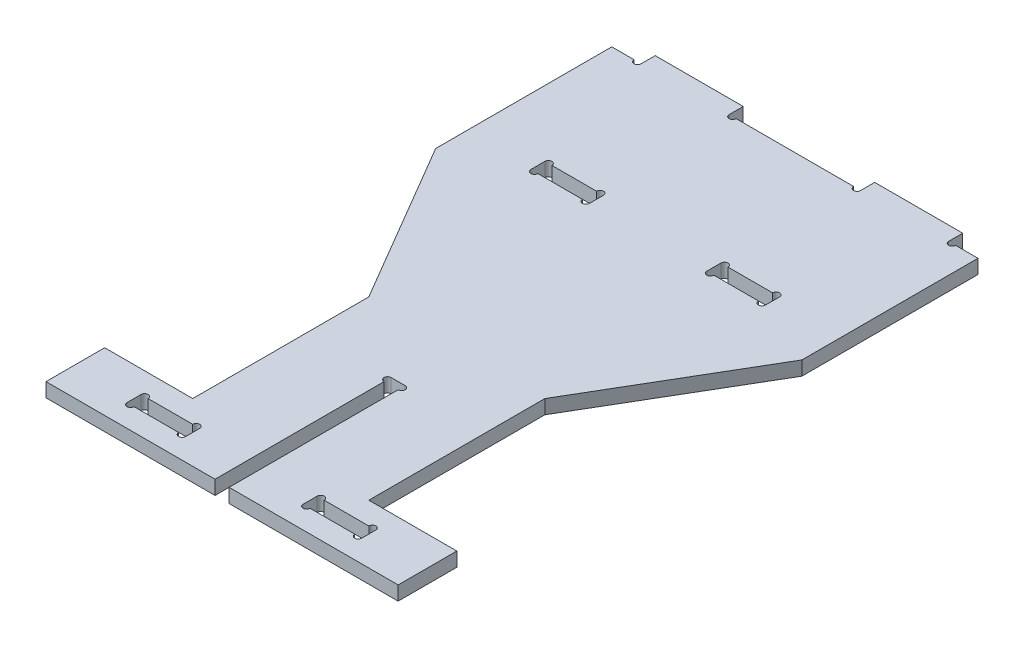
ISO-10303-21;
HEADER;
FILE_DESCRIPTION(('STEP AP214'),'2;1');
FILE_NAME('part.step','',(''),(''),'','','');
FILE_SCHEMA(('AUTOMOTIVE_DESIGN { 1 0 10303 214 1 1 1 1 }'));
ENDSEC;
DATA;
#1=APPLICATION_CONTEXT('core data for automotive mechanical design processes');
#2=APPLICATION_PROTOCOL_DEFINITION('international standard','automotive_design',2000,#1);
#3=PRODUCT_CONTEXT('',#1,'mechanical');
#4=PRODUCT('Part','Part','',(#3));
#5=PRODUCT_RELATED_PRODUCT_CATEGORY('part','',(#4));
#6=PRODUCT_DEFINITION_FORMATION('','',#4);
#7=PRODUCT_DEFINITION_CONTEXT('part definition',#1,'design');
#8=PRODUCT_DEFINITION('design','',#6,#7);
#9=PRODUCT_DEFINITION_SHAPE('','',#8);
#10=(LENGTH_UNIT() NAMED_UNIT(*) SI_UNIT(.MILLI.,.METRE.));
#11=(NAMED_UNIT(*) PLANE_ANGLE_UNIT() SI_UNIT($,.RADIAN.));
#12=(NAMED_UNIT(*) SI_UNIT($,.STERADIAN.) SOLID_ANGLE_UNIT());
#13=UNCERTAINTY_MEASURE_WITH_UNIT(LENGTH_MEASURE(1.E-05),#10,'distance_accuracy_value','');
#14=(GEOMETRIC_REPRESENTATION_CONTEXT(3) GLOBAL_UNCERTAINTY_ASSIGNED_CONTEXT((#13)) GLOBAL_UNIT_ASSIGNED_CONTEXT((#10,
#11,#12)) REPRESENTATION_CONTEXT('',''));
#15=CARTESIAN_POINT('',(0.,0.,0.));
#16=DIRECTION('',(0.,0.,1.));
#17=DIRECTION('',(1.,0.,0.));
#18=AXIS2_PLACEMENT_3D('',#15,#16,#17);
#19=CARTESIAN_POINT('',(134.,12.,-488.));
#20=DIRECTION('',(0.,1.,0.));
#21=DIRECTION('',(0.,0.,1.));
#22=AXIS2_PLACEMENT_3D('',#19,#20,#21);
#23=PLANE('',#22);
#24=DIRECTION('',(1.,0.,0.));
#25=VECTOR('',#24,1.);
#26=CARTESIAN_POINT('',(5.99999999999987,12.,0.));
#27=LINE('',#26,#25);
#28=CARTESIAN_POINT('',(5.99999999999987,12.,0.));
#29=VERTEX_POINT('',#28);
#30=CARTESIAN_POINT('',(150.,12.,0.));
#31=VERTEX_POINT('',#30);
#32=EDGE_CURVE('E668',#29,#31,#27,.T.);
#33=ORIENTED_EDGE('',*,*,#32,.T.);
#34=DIRECTION('',(0.,0.,-1.));
#35=VECTOR('',#34,1.);
#36=CARTESIAN_POINT('',(150.,12.,0.));
#37=LINE('',#36,#35);
#38=CARTESIAN_POINT('',(150.,12.,-50.));
#39=VERTEX_POINT('',#38);
#40=EDGE_CURVE('E671',#31,#39,#37,.T.);
#41=ORIENTED_EDGE('',*,*,#40,.T.);
#42=DIRECTION('',(-1.,0.,0.));
#43=VECTOR('',#42,1.);
#44=CARTESIAN_POINT('',(150.,12.,-50.));
#45=LINE('',#44,#43);
#46=CARTESIAN_POINT('',(75.,12.,-50.));
#47=VERTEX_POINT('',#46);
#48=EDGE_CURVE('E674',#39,#47,#45,.T.);
#49=ORIENTED_EDGE('',*,*,#48,.T.);
#50=DIRECTION('',(0.,0.,-1.));
#51=VECTOR('',#50,1.);
#52=CARTESIAN_POINT('',(75.,12.,-50.));
#53=LINE('',#52,#51);
#54=CARTESIAN_POINT('',(75.,12.,-200.));
#55=VERTEX_POINT('',#54);
#56=EDGE_CURVE('E676',#47,#55,#53,.T.);
#57=ORIENTED_EDGE('',*,*,#56,.T.);
#58=DIRECTION('',(0.506200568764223,0.,-0.862415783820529));
#59=VECTOR('',#58,1.);
#60=CARTESIAN_POINT('',(75.,12.,-200.));
#61=LINE('',#60,#59);
#62=CARTESIAN_POINT('',(156.,12.,-338.));
#63=VERTEX_POINT('',#62);
#64=EDGE_CURVE('E678',#55,#63,#61,.T.);
#65=ORIENTED_EDGE('',*,*,#64,.T.);
#66=DIRECTION('',(0.,0.,-1.));
#67=VECTOR('',#66,1.);
#68=CARTESIAN_POINT('',(156.,12.,-338.));
#69=LINE('',#68,#67);
#70=CARTESIAN_POINT('',(156.,12.,-488.));
#71=VERTEX_POINT('',#70);
#72=EDGE_CURVE('E680',#63,#71,#69,.T.);
#73=ORIENTED_EDGE('',*,*,#72,.T.);
#74=DIRECTION('',(-1.,0.,0.));
#75=VECTOR('',#74,1.);
#76=CARTESIAN_POINT('',(156.,12.,-488.));
#77=LINE('',#76,#75);
#78=CARTESIAN_POINT('',(137.,12.,-488.));
#79=VERTEX_POINT('',#78);
#80=EDGE_CURVE('E682',#71,#79,#77,.T.);
#81=ORIENTED_EDGE('',*,*,#80,.T.);
#82=CARTESIAN_POINT('',(134.,12.,-488.));
#83=DIRECTION('',(0.,-1.,0.));
#84=DIRECTION('',(0.,0.,1.));
#85=AXIS2_PLACEMENT_3D('',#82,#83,#84);
#86=CIRCLE('',#85,3.00000000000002);
#87=CARTESIAN_POINT('',(131.,12.,-488.));
#88=VERTEX_POINT('',#87);
#89=EDGE_CURVE('E684',#79,#88,#86,.T.);
#90=ORIENTED_EDGE('',*,*,#89,.T.);
#91=DIRECTION('',(0.,0.,-1.));
#92=VECTOR('',#91,1.);
#93=CARTESIAN_POINT('',(131.,12.,-488.));
#94=LINE('',#93,#92);
#95=CARTESIAN_POINT('',(131.,12.,-500.));
#96=VERTEX_POINT('',#95);
#97=EDGE_CURVE('E686',#88,#96,#94,.T.);
#98=ORIENTED_EDGE('',*,*,#97,.T.);
#99=DIRECTION('',(-1.,0.,0.));
#100=VECTOR('',#99,1.);
#101=CARTESIAN_POINT('',(131.,12.,-500.));
#102=LINE('',#101,#100);
#103=CARTESIAN_POINT('',(56.,12.,-500.));
#104=VERTEX_POINT('',#103);
#105=EDGE_CURVE('E688',#96,#104,#102,.T.);
#106=ORIENTED_EDGE('',*,*,#105,.T.);
#107=DIRECTION('',(0.,0.,1.));
#108=VECTOR('',#107,1.);
#109=CARTESIAN_POINT('',(56.,12.,-500.));
#110=LINE('',#109,#108);
#111=CARTESIAN_POINT('',(56.,12.,-488.));
#112=VERTEX_POINT('',#111);
#113=EDGE_CURVE('E690',#104,#112,#110,.T.);
#114=ORIENTED_EDGE('',*,*,#113,.T.);
#115=CARTESIAN_POINT('',(53.,12.,-488.));
#116=DIRECTION('',(0.,-1.,0.));
#117=DIRECTION('',(0.,0.,1.));
#118=AXIS2_PLACEMENT_3D('',#115,#116,#117);
#119=CIRCLE('',#118,3.);
#120=CARTESIAN_POINT('',(50.,12.,-488.));
#121=VERTEX_POINT('',#120);
#122=EDGE_CURVE('E692',#112,#121,#119,.T.);
#123=ORIENTED_EDGE('',*,*,#122,.T.);
#124=DIRECTION('',(-1.,0.,0.));
#125=VECTOR('',#124,1.);
#126=CARTESIAN_POINT('',(50.,12.,-488.));
#127=LINE('',#126,#125);
#128=CARTESIAN_POINT('',(-50.,12.,-488.));
#129=VERTEX_POINT('',#128);
#130=EDGE_CURVE('E694',#121,#129,#127,.T.);
#131=ORIENTED_EDGE('',*,*,#130,.T.);
#132=CARTESIAN_POINT('',(-53.,12.,-488.));
#133=DIRECTION('',(0.,-1.,0.));
#134=DIRECTION('',(0.,0.,1.));
#135=AXIS2_PLACEMENT_3D('',#132,#133,#134);
#136=CIRCLE('',#135,3.);
#137=CARTESIAN_POINT('',(-56.,12.,-488.));
#138=VERTEX_POINT('',#137);
#139=EDGE_CURVE('E696',#129,#138,#136,.T.);
#140=ORIENTED_EDGE('',*,*,#139,.T.);
#141=DIRECTION('',(0.,0.,-1.));
#142=VECTOR('',#141,1.);
#143=CARTESIAN_POINT('',(-56.,12.,-500.));
#144=LINE('',#143,#142);
#145=CARTESIAN_POINT('',(-56.,12.,-500.));
#146=VERTEX_POINT('',#145);
#147=EDGE_CURVE('E698',#138,#146,#144,.T.);
#148=ORIENTED_EDGE('',*,*,#147,.T.);
#149=DIRECTION('',(-1.,0.,0.));
#150=VECTOR('',#149,1.);
#151=CARTESIAN_POINT('',(-131.,12.,-500.));
#152=LINE('',#151,#150);
#153=CARTESIAN_POINT('',(-131.,12.,-500.));
#154=VERTEX_POINT('',#153);
#155=EDGE_CURVE('E700',#146,#154,#152,.T.);
#156=ORIENTED_EDGE('',*,*,#155,.T.);
#157=DIRECTION('',(0.,0.,1.));
#158=VECTOR('',#157,1.);
#159=CARTESIAN_POINT('',(-131.,12.,-488.));
#160=LINE('',#159,#158);
#161=CARTESIAN_POINT('',(-131.,12.,-488.));
#162=VERTEX_POINT('',#161);
#163=EDGE_CURVE('E702',#154,#162,#160,.T.);
#164=ORIENTED_EDGE('',*,*,#163,.T.);
#165=CARTESIAN_POINT('',(-134.,12.,-488.));
#166=DIRECTION('',(0.,-1.,0.));
#167=DIRECTION('',(0.,0.,1.));
#168=AXIS2_PLACEMENT_3D('',#165,#166,#167);
#169=CIRCLE('',#168,3.00000000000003);
#170=CARTESIAN_POINT('',(-137.,12.,-488.));
#171=VERTEX_POINT('',#170);
#172=EDGE_CURVE('E704',#162,#171,#169,.T.);
#173=ORIENTED_EDGE('',*,*,#172,.T.);
#174=DIRECTION('',(-1.,0.,0.));
#175=VECTOR('',#174,1.);
#176=CARTESIAN_POINT('',(-156.,12.,-488.));
#177=LINE('',#176,#175);
#178=CARTESIAN_POINT('',(-156.,12.,-488.));
#179=VERTEX_POINT('',#178);
#180=EDGE_CURVE('E706',#171,#179,#177,.T.);
#181=ORIENTED_EDGE('',*,*,#180,.T.);
#182=DIRECTION('',(0.,0.,1.));
#183=VECTOR('',#182,1.);
#184=CARTESIAN_POINT('',(-156.,12.,-338.));
#185=LINE('',#184,#183);
#186=CARTESIAN_POINT('',(-156.,12.,-338.));
#187=VERTEX_POINT('',#186);
#188=EDGE_CURVE('E708',#179,#187,#185,.T.);
#189=ORIENTED_EDGE('',*,*,#188,.T.);
#190=DIRECTION('',(0.506200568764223,0.,0.862415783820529));
#191=VECTOR('',#190,1.);
#192=CARTESIAN_POINT('',(-75.,12.,-200.));
#193=LINE('',#192,#191);
#194=CARTESIAN_POINT('',(-75.,12.,-200.));
#195=VERTEX_POINT('',#194);
#196=EDGE_CURVE('E710',#187,#195,#193,.T.);
#197=ORIENTED_EDGE('',*,*,#196,.T.);
#198=DIRECTION('',(0.,0.,1.));
#199=VECTOR('',#198,1.);
#200=CARTESIAN_POINT('',(-75.,12.,-50.));
#201=LINE('',#200,#199);
#202=CARTESIAN_POINT('',(-75.,12.,-50.));
#203=VERTEX_POINT('',#202);
#204=EDGE_CURVE('E712',#195,#203,#201,.T.);
#205=ORIENTED_EDGE('',*,*,#204,.T.);
#206=DIRECTION('',(-1.,0.,0.));
#207=VECTOR('',#206,1.);
#208=CARTESIAN_POINT('',(-150.,12.,-50.));
#209=LINE('',#208,#207);
#210=CARTESIAN_POINT('',(-150.,12.,-50.));
#211=VERTEX_POINT('',#210);
#212=EDGE_CURVE('E714',#203,#211,#209,.T.);
#213=ORIENTED_EDGE('',*,*,#212,.T.);
#214=DIRECTION('',(0.,0.,1.));
#215=VECTOR('',#214,1.);
#216=CARTESIAN_POINT('',(-150.,12.,0.));
#217=LINE('',#216,#215);
#218=CARTESIAN_POINT('',(-150.,12.,0.));
#219=VERTEX_POINT('',#218);
#220=EDGE_CURVE('E716',#211,#219,#217,.T.);
#221=ORIENTED_EDGE('',*,*,#220,.T.);
#222=DIRECTION('',(1.,0.,0.));
#223=VECTOR('',#222,1.);
#224=CARTESIAN_POINT('',(-150.,12.,0.));
#225=LINE('',#224,#223);
#226=CARTESIAN_POINT('',(-5.99999999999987,12.,0.));
#227=VERTEX_POINT('',#226);
#228=EDGE_CURVE('E718',#219,#227,#225,.T.);
#229=ORIENTED_EDGE('',*,*,#228,.T.);
#230=DIRECTION('',(0.,0.,-1.));
#231=VECTOR('',#230,1.);
#232=CARTESIAN_POINT('',(-5.99999999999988,12.,-144.));
#233=LINE('',#232,#231);
#234=CARTESIAN_POINT('',(-5.99999999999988,12.,-144.));
#235=VERTEX_POINT('',#234);
#236=EDGE_CURVE('E720',#227,#235,#233,.T.);
#237=ORIENTED_EDGE('',*,*,#236,.T.);
#238=CARTESIAN_POINT('',(-5.99999999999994,12.,-147.));
#239=DIRECTION('',(0.,-1.,0.));
#240=DIRECTION('',(0.,0.,1.));
#241=AXIS2_PLACEMENT_3D('',#238,#239,#240);
#242=CIRCLE('',#241,3.);
#243=CARTESIAN_POINT('',(-5.99999999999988,12.,-150.));
#244=VERTEX_POINT('',#243);
#245=EDGE_CURVE('E722',#235,#244,#242,.T.);
#246=ORIENTED_EDGE('',*,*,#245,.T.);
#247=DIRECTION('',(1.,0.,0.));
#248=VECTOR('',#247,1.);
#249=CARTESIAN_POINT('',(5.99999999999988,12.,-150.));
#250=LINE('',#249,#248);
#251=CARTESIAN_POINT('',(5.99999999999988,12.,-150.));
#252=VERTEX_POINT('',#251);
#253=EDGE_CURVE('E724',#244,#252,#250,.T.);
#254=ORIENTED_EDGE('',*,*,#253,.T.);
#255=CARTESIAN_POINT('',(6.00000000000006,12.,-147.));
#256=DIRECTION('',(0.,-1.,0.));
#257=DIRECTION('',(0.,0.,1.));
#258=AXIS2_PLACEMENT_3D('',#255,#256,#257);
#259=CIRCLE('',#258,3.);
#260=CARTESIAN_POINT('',(5.99999999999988,12.,-144.));
#261=VERTEX_POINT('',#260);
#262=EDGE_CURVE('E726',#252,#261,#259,.T.);
#263=ORIENTED_EDGE('',*,*,#262,.T.);
#264=DIRECTION('',(0.,0.,1.));
#265=VECTOR('',#264,1.);
#266=CARTESIAN_POINT('',(5.99999999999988,12.,-144.));
#267=LINE('',#266,#265);
#268=EDGE_CURVE('E728',#261,#29,#267,.T.);
#269=ORIENTED_EDGE('',*,*,#268,.T.);
#270=EDGE_LOOP('',(#33,#41,#49,#57,#65,#73,#81,#90,#98,#106,#114,#123,#131,#140,#148,#156,#164,
#173,#181,#189,#197,#205,#213,#221,#229,#237,#246,#254,#263,#269));
#271=FACE_BOUND('',#270,.T.);
#272=DIRECTION('',(1.,0.,0.));
#273=VECTOR('',#272,1.);
#274=CARTESIAN_POINT('',(56.0000000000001,12.,-19.));
#275=LINE('',#274,#273);
#276=CARTESIAN_POINT('',(56.0000000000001,12.,-19.));
#277=VERTEX_POINT('',#276);
#278=CARTESIAN_POINT('',(94.0000000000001,12.,-19.));
#279=VERTEX_POINT('',#278);
#280=EDGE_CURVE('E611',#277,#279,#275,.T.);
#281=ORIENTED_EDGE('',*,*,#280,.F.);
#282=CARTESIAN_POINT('',(53.0000000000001,12.,-19.));
#283=DIRECTION('',(0.,1.,0.));
#284=DIRECTION('',(0.,0.,1.));
#285=AXIS2_PLACEMENT_3D('',#282,#283,#284);
#286=CIRCLE('',#285,3.00000000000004);
#287=CARTESIAN_POINT('',(50.,12.,-19.));
#288=VERTEX_POINT('',#287);
#289=EDGE_CURVE('E609',#288,#277,#286,.T.);
#290=ORIENTED_EDGE('',*,*,#289,.F.);
#291=DIRECTION('',(0.,0.,1.));
#292=VECTOR('',#291,1.);
#293=CARTESIAN_POINT('',(50.,12.,-31.));
#294=LINE('',#293,#292);
#295=CARTESIAN_POINT('',(50.,12.,-31.));
#296=VERTEX_POINT('',#295);
#297=EDGE_CURVE('E625',#296,#288,#294,.T.);
#298=ORIENTED_EDGE('',*,*,#297,.F.);
#299=CARTESIAN_POINT('',(53.0000000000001,12.,-31.));
#300=DIRECTION('',(0.,1.,0.));
#301=DIRECTION('',(0.,0.,1.));
#302=AXIS2_PLACEMENT_3D('',#299,#300,#301);
#303=CIRCLE('',#302,3.00000000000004);
#304=CARTESIAN_POINT('',(56.0000000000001,12.,-31.));
#305=VERTEX_POINT('',#304);
#306=EDGE_CURVE('E622',#305,#296,#303,.T.);
#307=ORIENTED_EDGE('',*,*,#306,.F.);
#308=DIRECTION('',(-1.,0.,0.));
#309=VECTOR('',#308,1.);
#310=CARTESIAN_POINT('',(56.0000000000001,12.,-31.));
#311=LINE('',#310,#309);
#312=CARTESIAN_POINT('',(94.0000000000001,12.,-31.));
#313=VERTEX_POINT('',#312);
#314=EDGE_CURVE('E620',#313,#305,#311,.T.);
#315=ORIENTED_EDGE('',*,*,#314,.F.);
#316=CARTESIAN_POINT('',(97.0000000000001,12.,-31.));
#317=DIRECTION('',(0.,1.,0.));
#318=DIRECTION('',(0.,0.,1.));
#319=AXIS2_PLACEMENT_3D('',#316,#317,#318);
#320=CIRCLE('',#319,2.99999999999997);
#321=CARTESIAN_POINT('',(100.,12.,-31.));
#322=VERTEX_POINT('',#321);
#323=EDGE_CURVE('E618',#322,#313,#320,.T.);
#324=ORIENTED_EDGE('',*,*,#323,.F.);
#325=DIRECTION('',(0.,0.,-1.));
#326=VECTOR('',#325,1.);
#327=CARTESIAN_POINT('',(100.,12.,-31.));
#328=LINE('',#327,#326);
#329=CARTESIAN_POINT('',(100.,12.,-19.));
#330=VERTEX_POINT('',#329);
#331=EDGE_CURVE('E616',#330,#322,#328,.T.);
#332=ORIENTED_EDGE('',*,*,#331,.F.);
#333=CARTESIAN_POINT('',(97.0000000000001,12.,-19.));
#334=DIRECTION('',(0.,1.,0.));
#335=DIRECTION('',(0.,0.,1.));
#336=AXIS2_PLACEMENT_3D('',#333,#334,#335);
#337=CIRCLE('',#336,2.99999999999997);
#338=EDGE_CURVE('E614',#279,#330,#337,.T.);
#339=ORIENTED_EDGE('',*,*,#338,.F.);
#340=EDGE_LOOP('',(#281,#290,#298,#307,#315,#324,#332,#339));
#341=FACE_BOUND('',#340,.T.);
#342=DIRECTION('',(0.,0.,1.));
#343=VECTOR('',#342,1.);
#344=CARTESIAN_POINT('',(50.0000000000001,12.,-375.));
#345=LINE('',#344,#343);
#346=CARTESIAN_POINT('',(50.0000000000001,12.,-375.));
#347=VERTEX_POINT('',#346);
#348=CARTESIAN_POINT('',(50.0000000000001,12.,-363.));
#349=VERTEX_POINT('',#348);
#350=EDGE_CURVE('E552',#347,#349,#345,.T.);
#351=ORIENTED_EDGE('',*,*,#350,.F.);
#352=CARTESIAN_POINT('',(53.0000000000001,12.,-375.));
#353=DIRECTION('',(0.,1.,0.));
#354=DIRECTION('',(0.,0.,1.));
#355=AXIS2_PLACEMENT_3D('',#352,#353,#354);
#356=CIRCLE('',#355,3.);
#357=CARTESIAN_POINT('',(56.0000000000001,12.,-375.));
#358=VERTEX_POINT('',#357);
#359=EDGE_CURVE('E550',#358,#347,#356,.T.);
#360=ORIENTED_EDGE('',*,*,#359,.F.);
#361=DIRECTION('',(-1.,0.,0.));
#362=VECTOR('',#361,1.);
#363=CARTESIAN_POINT('',(56.0000000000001,12.,-375.));
#364=LINE('',#363,#362);
#365=CARTESIAN_POINT('',(94.0000000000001,12.,-375.));
#366=VERTEX_POINT('',#365);
#367=EDGE_CURVE('E566',#366,#358,#364,.T.);
#368=ORIENTED_EDGE('',*,*,#367,.F.);
#369=CARTESIAN_POINT('',(97.0000000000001,12.,-375.));
#370=DIRECTION('',(0.,1.,0.));
#371=DIRECTION('',(0.,0.,1.));
#372=AXIS2_PLACEMENT_3D('',#369,#370,#371);
#373=CIRCLE('',#372,3.);
#374=CARTESIAN_POINT('',(100.,12.,-375.));
#375=VERTEX_POINT('',#374);
#376=EDGE_CURVE('E563',#375,#366,#373,.T.);
#377=ORIENTED_EDGE('',*,*,#376,.F.);
#378=DIRECTION('',(0.,0.,-1.));
#379=VECTOR('',#378,1.);
#380=CARTESIAN_POINT('',(100.,12.,-375.));
#381=LINE('',#380,#379);
#382=CARTESIAN_POINT('',(100.,12.,-363.));
#383=VERTEX_POINT('',#382);
#384=EDGE_CURVE('E561',#383,#375,#381,.T.);
#385=ORIENTED_EDGE('',*,*,#384,.F.);
#386=CARTESIAN_POINT('',(97.0000000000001,12.,-363.));
#387=DIRECTION('',(0.,1.,0.));
#388=DIRECTION('',(0.,0.,1.));
#389=AXIS2_PLACEMENT_3D('',#386,#387,#388);
#390=CIRCLE('',#389,3.00000000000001);
#391=CARTESIAN_POINT('',(94.0000000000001,12.,-363.));
#392=VERTEX_POINT('',#391);
#393=EDGE_CURVE('E559',#392,#383,#390,.T.);
#394=ORIENTED_EDGE('',*,*,#393,.F.);
#395=DIRECTION('',(1.,0.,0.));
#396=VECTOR('',#395,1.);
#397=CARTESIAN_POINT('',(56.0000000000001,12.,-363.));
#398=LINE('',#397,#396);
#399=CARTESIAN_POINT('',(56.0000000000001,12.,-363.));
#400=VERTEX_POINT('',#399);
#401=EDGE_CURVE('E557',#400,#392,#398,.T.);
#402=ORIENTED_EDGE('',*,*,#401,.F.);
#403=CARTESIAN_POINT('',(53.0000000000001,12.,-363.));
#404=DIRECTION('',(0.,1.,0.));
#405=DIRECTION('',(0.,0.,1.));
#406=AXIS2_PLACEMENT_3D('',#403,#404,#405);
#407=CIRCLE('',#406,3.);
#408=EDGE_CURVE('E555',#349,#400,#407,.T.);
#409=ORIENTED_EDGE('',*,*,#408,.F.);
#410=EDGE_LOOP('',(#351,#360,#368,#377,#385,#394,#402,#409));
#411=FACE_BOUND('',#410,.T.);
#412=DIRECTION('',(-1.,0.,0.));
#413=VECTOR('',#412,1.);
#414=CARTESIAN_POINT('',(-56.0000000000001,12.,-375.));
#415=LINE('',#414,#413);
#416=CARTESIAN_POINT('',(-56.0000000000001,12.,-375.));
#417=VERTEX_POINT('',#416);
#418=CARTESIAN_POINT('',(-94.0000000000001,12.,-375.));
#419=VERTEX_POINT('',#418);
#420=EDGE_CURVE('E493',#417,#419,#415,.T.);
#421=ORIENTED_EDGE('',*,*,#420,.F.);
#422=CARTESIAN_POINT('',(-53.0000000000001,12.,-375.));
#423=DIRECTION('',(0.,1.,0.));
#424=DIRECTION('',(0.,0.,-1.));
#425=AXIS2_PLACEMENT_3D('',#422,#423,#424);
#426=CIRCLE('',#425,3.);
#427=CARTESIAN_POINT('',(-50.0000000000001,12.,-375.));
#428=VERTEX_POINT('',#427);
#429=EDGE_CURVE('E491',#428,#417,#426,.T.);
#430=ORIENTED_EDGE('',*,*,#429,.F.);
#431=DIRECTION('',(0.,0.,-1.));
#432=VECTOR('',#431,1.);
#433=CARTESIAN_POINT('',(-50.0000000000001,12.,-375.));
#434=LINE('',#433,#432);
#435=CARTESIAN_POINT('',(-50.0000000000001,12.,-363.));
#436=VERTEX_POINT('',#435);
#437=EDGE_CURVE('E507',#436,#428,#434,.T.);
#438=ORIENTED_EDGE('',*,*,#437,.F.);
#439=CARTESIAN_POINT('',(-53.0000000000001,12.,-363.));
#440=DIRECTION('',(0.,1.,0.));
#441=DIRECTION('',(0.,0.,-1.));
#442=AXIS2_PLACEMENT_3D('',#439,#440,#441);
#443=CIRCLE('',#442,3.);
#444=CARTESIAN_POINT('',(-56.0000000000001,12.,-363.));
#445=VERTEX_POINT('',#444);
#446=EDGE_CURVE('E504',#445,#436,#443,.T.);
#447=ORIENTED_EDGE('',*,*,#446,.F.);
#448=DIRECTION('',(1.,0.,0.));
#449=VECTOR('',#448,1.);
#450=CARTESIAN_POINT('',(-56.0000000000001,12.,-363.));
#451=LINE('',#450,#449);
#452=CARTESIAN_POINT('',(-94.0000000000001,12.,-363.));
#453=VERTEX_POINT('',#452);
#454=EDGE_CURVE('E502',#453,#445,#451,.T.);
#455=ORIENTED_EDGE('',*,*,#454,.F.);
#456=CARTESIAN_POINT('',(-97.0000000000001,12.,-363.));
#457=DIRECTION('',(0.,1.,0.));
#458=DIRECTION('',(0.,0.,-1.));
#459=AXIS2_PLACEMENT_3D('',#456,#457,#458);
#460=CIRCLE('',#459,3.00000000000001);
#461=CARTESIAN_POINT('',(-100.,12.,-363.));
#462=VERTEX_POINT('',#461);
#463=EDGE_CURVE('E500',#462,#453,#460,.T.);
#464=ORIENTED_EDGE('',*,*,#463,.F.);
#465=DIRECTION('',(0.,0.,1.));
#466=VECTOR('',#465,1.);
#467=CARTESIAN_POINT('',(-100.,12.,-375.));
#468=LINE('',#467,#466);
#469=CARTESIAN_POINT('',(-100.,12.,-375.));
#470=VERTEX_POINT('',#469);
#471=EDGE_CURVE('E498',#470,#462,#468,.T.);
#472=ORIENTED_EDGE('',*,*,#471,.F.);
#473=CARTESIAN_POINT('',(-97.0000000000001,12.,-375.));
#474=DIRECTION('',(0.,1.,0.));
#475=DIRECTION('',(0.,0.,-1.));
#476=AXIS2_PLACEMENT_3D('',#473,#474,#475);
#477=CIRCLE('',#476,3.);
#478=EDGE_CURVE('E496',#419,#470,#477,.T.);
#479=ORIENTED_EDGE('',*,*,#478,.F.);
#480=EDGE_LOOP('',(#421,#430,#438,#447,#455,#464,#472,#479));
#481=FACE_BOUND('',#480,.T.);
#482=DIRECTION('',(1.,0.,0.));
#483=VECTOR('',#482,1.);
#484=CARTESIAN_POINT('',(-56.0000000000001,12.,-19.));
#485=LINE('',#484,#483);
#486=CARTESIAN_POINT('',(-94.0000000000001,12.,-19.));
#487=VERTEX_POINT('',#486);
#488=CARTESIAN_POINT('',(-56.0000000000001,12.,-19.));
#489=VERTEX_POINT('',#488);
#490=EDGE_CURVE('E434',#487,#489,#485,.T.);
#491=ORIENTED_EDGE('',*,*,#490,.F.);
#492=CARTESIAN_POINT('',(-97.0000000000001,12.,-19.));
#493=DIRECTION('',(0.,1.,0.));
#494=DIRECTION('',(0.,0.,-1.));
#495=AXIS2_PLACEMENT_3D('',#492,#493,#494);
#496=CIRCLE('',#495,2.99999999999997);
#497=CARTESIAN_POINT('',(-100.,12.,-19.));
#498=VERTEX_POINT('',#497);
#499=EDGE_CURVE('E426',#498,#487,#496,.T.);
#500=ORIENTED_EDGE('',*,*,#499,.F.);
#501=DIRECTION('',(0.,0.,1.));
#502=VECTOR('',#501,1.);
#503=CARTESIAN_POINT('',(-100.,12.,-31.));
#504=LINE('',#503,#502);
#505=CARTESIAN_POINT('',(-100.,12.,-31.));
#506=VERTEX_POINT('',#505);
#507=EDGE_CURVE('E459',#506,#498,#504,.T.);
#508=ORIENTED_EDGE('',*,*,#507,.F.);
#509=CARTESIAN_POINT('',(-97.0000000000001,12.,-31.));
#510=DIRECTION('',(0.,1.,0.));
#511=DIRECTION('',(0.,0.,-1.));
#512=AXIS2_PLACEMENT_3D('',#509,#510,#511);
#513=CIRCLE('',#512,2.99999999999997);
#514=CARTESIAN_POINT('',(-94.0000000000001,12.,-31.));
#515=VERTEX_POINT('',#514);
#516=EDGE_CURVE('E457',#515,#506,#513,.T.);
#517=ORIENTED_EDGE('',*,*,#516,.F.);
#518=DIRECTION('',(-1.,0.,0.));
#519=VECTOR('',#518,1.);
#520=CARTESIAN_POINT('',(-56.0000000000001,12.,-31.));
#521=LINE('',#520,#519);
#522=CARTESIAN_POINT('',(-56.0000000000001,12.,-31.));
#523=VERTEX_POINT('',#522);
#524=EDGE_CURVE('E455',#523,#515,#521,.T.);
#525=ORIENTED_EDGE('',*,*,#524,.F.);
#526=CARTESIAN_POINT('',(-53.0000000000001,12.,-31.));
#527=DIRECTION('',(0.,1.,0.));
#528=DIRECTION('',(0.,0.,-1.));
#529=AXIS2_PLACEMENT_3D('',#526,#527,#528);
#530=CIRCLE('',#529,3.00000000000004);
#531=CARTESIAN_POINT('',(-50.,12.,-31.));
#532=VERTEX_POINT('',#531);
#533=EDGE_CURVE('E453',#532,#523,#530,.T.);
#534=ORIENTED_EDGE('',*,*,#533,.F.);
#535=DIRECTION('',(0.,0.,-1.));
#536=VECTOR('',#535,1.);
#537=CARTESIAN_POINT('',(-50.,12.,-31.));
#538=LINE('',#537,#536);
#539=CARTESIAN_POINT('',(-50.,12.,-19.));
#540=VERTEX_POINT('',#539);
#541=EDGE_CURVE('E449',#540,#532,#538,.T.);
#542=ORIENTED_EDGE('',*,*,#541,.F.);
#543=CARTESIAN_POINT('',(-53.0000000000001,12.,-19.));
#544=DIRECTION('',(0.,1.,0.));
#545=DIRECTION('',(0.,0.,-1.));
#546=AXIS2_PLACEMENT_3D('',#543,#544,#545);
#547=CIRCLE('',#546,3.00000000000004);
#548=EDGE_CURVE('E447',#489,#540,#547,.T.);
#549=ORIENTED_EDGE('',*,*,#548,.F.);
#550=EDGE_LOOP('',(#491,#500,#508,#517,#525,#534,#542,#549));
#551=FACE_BOUND('',#550,.T.);
#552=ADVANCED_FACE('F37',(#271,#341,#411,#481,#551),#23,.T.);
#553=CARTESIAN_POINT('',(134.,0.,-488.));
#554=DIRECTION('',(0.,1.,0.));
#555=DIRECTION('',(0.,0.,1.));
#556=AXIS2_PLACEMENT_3D('',#553,#554,#555);
#557=PLANE('',#556);
#558=CARTESIAN_POINT('',(-53.0000000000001,0.,-375.));
#559=DIRECTION('',(0.,1.,0.));
#560=DIRECTION('',(0.,0.,-1.));
#561=AXIS2_PLACEMENT_3D('',#558,#559,#560);
#562=CIRCLE('',#561,3.);
#563=CARTESIAN_POINT('',(-50.0000000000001,0.,-375.));
#564=VERTEX_POINT('',#563);
#565=CARTESIAN_POINT('',(-56.0000000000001,0.,-375.));
#566=VERTEX_POINT('',#565);
#567=EDGE_CURVE('E442',#564,#566,#562,.T.);
#568=ORIENTED_EDGE('',*,*,#567,.T.);
#569=DIRECTION('',(-1.,0.,0.));
#570=VECTOR('',#569,1.);
#571=CARTESIAN_POINT('',(-56.0000000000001,0.,-375.));
#572=LINE('',#571,#570);
#573=CARTESIAN_POINT('',(-94.0000000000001,0.,-375.));
#574=VERTEX_POINT('',#573);
#575=EDGE_CURVE('E512',#566,#574,#572,.T.);
#576=ORIENTED_EDGE('',*,*,#575,.T.);
#577=CARTESIAN_POINT('',(-97.0000000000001,0.,-375.));
#578=DIRECTION('',(0.,1.,0.));
#579=DIRECTION('',(0.,0.,-1.));
#580=AXIS2_PLACEMENT_3D('',#577,#578,#579);
#581=CIRCLE('',#580,3.);
#582=CARTESIAN_POINT('',(-100.,0.,-375.));
#583=VERTEX_POINT('',#582);
#584=EDGE_CURVE('E515',#574,#583,#581,.T.);
#585=ORIENTED_EDGE('',*,*,#584,.T.);
#586=DIRECTION('',(0.,0.,1.));
#587=VECTOR('',#586,1.);
#588=CARTESIAN_POINT('',(-100.,0.,-375.));
#589=LINE('',#588,#587);
#590=CARTESIAN_POINT('',(-100.,0.,-363.));
#591=VERTEX_POINT('',#590);
#592=EDGE_CURVE('E518',#583,#591,#589,.T.);
#593=ORIENTED_EDGE('',*,*,#592,.T.);
#594=CARTESIAN_POINT('',(-97.0000000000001,0.,-363.));
#595=DIRECTION('',(0.,1.,0.));
#596=DIRECTION('',(0.,0.,-1.));
#597=AXIS2_PLACEMENT_3D('',#594,#595,#596);
#598=CIRCLE('',#597,3.00000000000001);
#599=CARTESIAN_POINT('',(-94.0000000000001,0.,-363.));
#600=VERTEX_POINT('',#599);
#601=EDGE_CURVE('E521',#591,#600,#598,.T.);
#602=ORIENTED_EDGE('',*,*,#601,.T.);
#603=DIRECTION('',(1.,0.,0.));
#604=VECTOR('',#603,1.);
#605=CARTESIAN_POINT('',(-56.0000000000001,0.,-363.));
#606=LINE('',#605,#604);
#607=CARTESIAN_POINT('',(-56.0000000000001,0.,-363.));
#608=VERTEX_POINT('',#607);
#609=EDGE_CURVE('E524',#600,#608,#606,.T.);
#610=ORIENTED_EDGE('',*,*,#609,.T.);
#611=CARTESIAN_POINT('',(-53.0000000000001,0.,-363.));
#612=DIRECTION('',(0.,1.,0.));
#613=DIRECTION('',(0.,0.,-1.));
#614=AXIS2_PLACEMENT_3D('',#611,#612,#613);
#615=CIRCLE('',#614,3.);
#616=CARTESIAN_POINT('',(-50.0000000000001,0.,-363.));
#617=VERTEX_POINT('',#616);
#618=EDGE_CURVE('E527',#608,#617,#615,.T.);
#619=ORIENTED_EDGE('',*,*,#618,.T.);
#620=DIRECTION('',(0.,0.,-1.));
#621=VECTOR('',#620,1.);
#622=CARTESIAN_POINT('',(-50.0000000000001,0.,-375.));
#623=LINE('',#622,#621);
#624=EDGE_CURVE('E494',#617,#564,#623,.T.);
#625=ORIENTED_EDGE('',*,*,#624,.T.);
#626=EDGE_LOOP('',(#568,#576,#585,#593,#602,#610,#619,#625));
#627=FACE_BOUND('',#626,.T.);
#628=CARTESIAN_POINT('',(53.0000000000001,0.,-19.));
#629=DIRECTION('',(0.,1.,0.));
#630=DIRECTION('',(0.,0.,1.));
#631=AXIS2_PLACEMENT_3D('',#628,#629,#630);
#632=CIRCLE('',#631,3.00000000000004);
#633=CARTESIAN_POINT('',(50.,0.,-19.));
#634=VERTEX_POINT('',#633);
#635=CARTESIAN_POINT('',(56.0000000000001,0.,-19.));
#636=VERTEX_POINT('',#635);
#637=EDGE_CURVE('E608',#634,#636,#632,.T.);
#638=ORIENTED_EDGE('',*,*,#637,.T.);
#639=DIRECTION('',(1.,0.,0.));
#640=VECTOR('',#639,1.);
#641=CARTESIAN_POINT('',(56.0000000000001,0.,-19.));
#642=LINE('',#641,#640);
#643=CARTESIAN_POINT('',(94.0000000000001,0.,-19.));
#644=VERTEX_POINT('',#643);
#645=EDGE_CURVE('E630',#636,#644,#642,.T.);
#646=ORIENTED_EDGE('',*,*,#645,.T.);
#647=CARTESIAN_POINT('',(97.0000000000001,0.,-19.));
#648=DIRECTION('',(0.,1.,0.));
#649=DIRECTION('',(0.,0.,1.));
#650=AXIS2_PLACEMENT_3D('',#647,#648,#649);
#651=CIRCLE('',#650,2.99999999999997);
#652=CARTESIAN_POINT('',(100.,0.,-19.));
#653=VERTEX_POINT('',#652);
#654=EDGE_CURVE('E633',#644,#653,#651,.T.);
#655=ORIENTED_EDGE('',*,*,#654,.T.);
#656=DIRECTION('',(0.,0.,-1.));
#657=VECTOR('',#656,1.);
#658=CARTESIAN_POINT('',(100.,0.,-31.));
#659=LINE('',#658,#657);
#660=CARTESIAN_POINT('',(100.,0.,-31.));
#661=VERTEX_POINT('',#660);
#662=EDGE_CURVE('E636',#653,#661,#659,.T.);
#663=ORIENTED_EDGE('',*,*,#662,.T.);
#664=CARTESIAN_POINT('',(97.0000000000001,0.,-31.));
#665=DIRECTION('',(0.,1.,0.));
#666=DIRECTION('',(0.,0.,1.));
#667=AXIS2_PLACEMENT_3D('',#664,#665,#666);
#668=CIRCLE('',#667,2.99999999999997);
#669=CARTESIAN_POINT('',(94.0000000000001,0.,-31.));
#670=VERTEX_POINT('',#669);
#671=EDGE_CURVE('E639',#661,#670,#668,.T.);
#672=ORIENTED_EDGE('',*,*,#671,.T.);
#673=DIRECTION('',(-1.,0.,0.));
#674=VECTOR('',#673,1.);
#675=CARTESIAN_POINT('',(56.0000000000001,0.,-31.));
#676=LINE('',#675,#674);
#677=CARTESIAN_POINT('',(56.0000000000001,0.,-31.));
#678=VERTEX_POINT('',#677);
#679=EDGE_CURVE('E642',#670,#678,#676,.T.);
#680=ORIENTED_EDGE('',*,*,#679,.T.);
#681=CARTESIAN_POINT('',(53.0000000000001,0.,-31.));
#682=DIRECTION('',(0.,1.,0.));
#683=DIRECTION('',(0.,0.,1.));
#684=AXIS2_PLACEMENT_3D('',#681,#682,#683);
#685=CIRCLE('',#684,3.00000000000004);
#686=CARTESIAN_POINT('',(50.,0.,-31.));
#687=VERTEX_POINT('',#686);
#688=EDGE_CURVE('E645',#678,#687,#685,.T.);
#689=ORIENTED_EDGE('',*,*,#688,.T.);
#690=DIRECTION('',(0.,0.,1.));
#691=VECTOR('',#690,1.);
#692=CARTESIAN_POINT('',(50.,0.,-31.));
#693=LINE('',#692,#691);
#694=EDGE_CURVE('E612',#687,#634,#693,.T.);
#695=ORIENTED_EDGE('',*,*,#694,.T.);
#696=EDGE_LOOP('',(#638,#646,#655,#663,#672,#680,#689,#695));
#697=FACE_BOUND('',#696,.T.);
#698=DIRECTION('',(1.,0.,0.));
#699=VECTOR('',#698,1.);
#700=CARTESIAN_POINT('',(5.99999999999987,0.,0.));
#701=LINE('',#700,#699);
#702=CARTESIAN_POINT('',(5.99999999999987,0.,0.));
#703=VERTEX_POINT('',#702);
#704=CARTESIAN_POINT('',(150.,0.,0.));
#705=VERTEX_POINT('',#704);
#706=EDGE_CURVE('E667',#703,#705,#701,.T.);
#707=ORIENTED_EDGE('',*,*,#706,.F.);
#708=DIRECTION('',(0.,0.,1.));
#709=VECTOR('',#708,1.);
#710=CARTESIAN_POINT('',(5.99999999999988,0.,-144.));
#711=LINE('',#710,#709);
#712=CARTESIAN_POINT('',(5.99999999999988,0.,-144.));
#713=VERTEX_POINT('',#712);
#714=EDGE_CURVE('E672',#713,#703,#711,.T.);
#715=ORIENTED_EDGE('',*,*,#714,.F.);
#716=CARTESIAN_POINT('',(6.00000000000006,0.,-147.));
#717=DIRECTION('',(0.,-1.,0.));
#718=DIRECTION('',(0.,0.,1.));
#719=AXIS2_PLACEMENT_3D('',#716,#717,#718);
#720=CIRCLE('',#719,3.);
#721=CARTESIAN_POINT('',(5.99999999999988,0.,-150.));
#722=VERTEX_POINT('',#721);
#723=EDGE_CURVE('E788',#722,#713,#720,.T.);
#724=ORIENTED_EDGE('',*,*,#723,.F.);
#725=DIRECTION('',(1.,0.,0.));
#726=VECTOR('',#725,1.);
#727=CARTESIAN_POINT('',(5.99999999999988,0.,-150.));
#728=LINE('',#727,#726);
#729=CARTESIAN_POINT('',(-5.99999999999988,0.,-150.));
#730=VERTEX_POINT('',#729);
#731=EDGE_CURVE('E786',#730,#722,#728,.T.);
#732=ORIENTED_EDGE('',*,*,#731,.F.);
#733=CARTESIAN_POINT('',(-5.99999999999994,0.,-147.));
#734=DIRECTION('',(0.,-1.,0.));
#735=DIRECTION('',(0.,0.,1.));
#736=AXIS2_PLACEMENT_3D('',#733,#734,#735);
#737=CIRCLE('',#736,3.);
#738=CARTESIAN_POINT('',(-5.99999999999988,0.,-144.));
#739=VERTEX_POINT('',#738);
#740=EDGE_CURVE('E784',#739,#730,#737,.T.);
#741=ORIENTED_EDGE('',*,*,#740,.F.);
#742=DIRECTION('',(0.,0.,-1.));
#743=VECTOR('',#742,1.);
#744=CARTESIAN_POINT('',(-5.99999999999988,0.,-144.));
#745=LINE('',#744,#743);
#746=CARTESIAN_POINT('',(-5.99999999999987,0.,0.));
#747=VERTEX_POINT('',#746);
#748=EDGE_CURVE('E782',#747,#739,#745,.T.);
#749=ORIENTED_EDGE('',*,*,#748,.F.);
#750=DIRECTION('',(1.,0.,0.));
#751=VECTOR('',#750,1.);
#752=CARTESIAN_POINT('',(-150.,0.,0.));
#753=LINE('',#752,#751);
#754=CARTESIAN_POINT('',(-150.,0.,0.));
#755=VERTEX_POINT('',#754);
#756=EDGE_CURVE('E780',#755,#747,#753,.T.);
#757=ORIENTED_EDGE('',*,*,#756,.F.);
#758=DIRECTION('',(0.,0.,1.));
#759=VECTOR('',#758,1.);
#760=CARTESIAN_POINT('',(-150.,0.,0.));
#761=LINE('',#760,#759);
#762=CARTESIAN_POINT('',(-150.,0.,-50.));
#763=VERTEX_POINT('',#762);
#764=EDGE_CURVE('E778',#763,#755,#761,.T.);
#765=ORIENTED_EDGE('',*,*,#764,.F.);
#766=DIRECTION('',(-1.,0.,0.));
#767=VECTOR('',#766,1.);
#768=CARTESIAN_POINT('',(-150.,0.,-50.));
#769=LINE('',#768,#767);
#770=CARTESIAN_POINT('',(-75.,0.,-50.));
#771=VERTEX_POINT('',#770);
#772=EDGE_CURVE('E776',#771,#763,#769,.T.);
#773=ORIENTED_EDGE('',*,*,#772,.F.);
#774=DIRECTION('',(0.,0.,1.));
#775=VECTOR('',#774,1.);
#776=CARTESIAN_POINT('',(-75.,0.,-50.));
#777=LINE('',#776,#775);
#778=CARTESIAN_POINT('',(-75.,0.,-200.));
#779=VERTEX_POINT('',#778);
#780=EDGE_CURVE('E774',#779,#771,#777,.T.);
#781=ORIENTED_EDGE('',*,*,#780,.F.);
#782=DIRECTION('',(0.506200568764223,0.,0.862415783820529));
#783=VECTOR('',#782,1.);
#784=CARTESIAN_POINT('',(-75.,0.,-200.));
#785=LINE('',#784,#783);
#786=CARTESIAN_POINT('',(-156.,0.,-338.));
#787=VERTEX_POINT('',#786);
#788=EDGE_CURVE('E772',#787,#779,#785,.T.);
#789=ORIENTED_EDGE('',*,*,#788,.F.);
#790=DIRECTION('',(0.,0.,1.));
#791=VECTOR('',#790,1.);
#792=CARTESIAN_POINT('',(-156.,0.,-338.));
#793=LINE('',#792,#791);
#794=CARTESIAN_POINT('',(-156.,0.,-488.));
#795=VERTEX_POINT('',#794);
#796=EDGE_CURVE('E770',#795,#787,#793,.T.);
#797=ORIENTED_EDGE('',*,*,#796,.F.);
#798=DIRECTION('',(-1.,0.,0.));
#799=VECTOR('',#798,1.);
#800=CARTESIAN_POINT('',(-156.,0.,-488.));
#801=LINE('',#800,#799);
#802=CARTESIAN_POINT('',(-137.,0.,-488.));
#803=VERTEX_POINT('',#802);
#804=EDGE_CURVE('E768',#803,#795,#801,.T.);
#805=ORIENTED_EDGE('',*,*,#804,.F.);
#806=CARTESIAN_POINT('',(-134.,0.,-488.));
#807=DIRECTION('',(0.,-1.,0.));
#808=DIRECTION('',(0.,0.,1.));
#809=AXIS2_PLACEMENT_3D('',#806,#807,#808);
#810=CIRCLE('',#809,3.00000000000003);
#811=CARTESIAN_POINT('',(-131.,0.,-488.));
#812=VERTEX_POINT('',#811);
#813=EDGE_CURVE('E766',#812,#803,#810,.T.);
#814=ORIENTED_EDGE('',*,*,#813,.F.);
#815=DIRECTION('',(0.,0.,1.));
#816=VECTOR('',#815,1.);
#817=CARTESIAN_POINT('',(-131.,0.,-488.));
#818=LINE('',#817,#816);
#819=CARTESIAN_POINT('',(-131.,0.,-500.));
#820=VERTEX_POINT('',#819);
#821=EDGE_CURVE('E764',#820,#812,#818,.T.);
#822=ORIENTED_EDGE('',*,*,#821,.F.);
#823=DIRECTION('',(-1.,0.,0.));
#824=VECTOR('',#823,1.);
#825=CARTESIAN_POINT('',(-131.,0.,-500.));
#826=LINE('',#825,#824);
#827=CARTESIAN_POINT('',(-56.,0.,-500.));
#828=VERTEX_POINT('',#827);
#829=EDGE_CURVE('E762',#828,#820,#826,.T.);
#830=ORIENTED_EDGE('',*,*,#829,.F.);
#831=DIRECTION('',(0.,0.,-1.));
#832=VECTOR('',#831,1.);
#833=CARTESIAN_POINT('',(-56.,0.,-500.));
#834=LINE('',#833,#832);
#835=CARTESIAN_POINT('',(-56.,0.,-488.));
#836=VERTEX_POINT('',#835);
#837=EDGE_CURVE('E760',#836,#828,#834,.T.);
#838=ORIENTED_EDGE('',*,*,#837,.F.);
#839=CARTESIAN_POINT('',(-53.,0.,-488.));
#840=DIRECTION('',(0.,-1.,0.));
#841=DIRECTION('',(0.,0.,1.));
#842=AXIS2_PLACEMENT_3D('',#839,#840,#841);
#843=CIRCLE('',#842,3.);
#844=CARTESIAN_POINT('',(-50.,0.,-488.));
#845=VERTEX_POINT('',#844);
#846=EDGE_CURVE('E758',#845,#836,#843,.T.);
#847=ORIENTED_EDGE('',*,*,#846,.F.);
#848=DIRECTION('',(-1.,0.,0.));
#849=VECTOR('',#848,1.);
#850=CARTESIAN_POINT('',(-50.,0.,-488.));
#851=LINE('',#850,#849);
#852=CARTESIAN_POINT('',(50.,0.,-488.));
#853=VERTEX_POINT('',#852);
#854=EDGE_CURVE('E756',#853,#845,#851,.T.);
#855=ORIENTED_EDGE('',*,*,#854,.F.);
#856=CARTESIAN_POINT('',(53.,0.,-488.));
#857=DIRECTION('',(0.,-1.,0.));
#858=DIRECTION('',(0.,0.,1.));
#859=AXIS2_PLACEMENT_3D('',#856,#857,#858);
#860=CIRCLE('',#859,3.);
#861=CARTESIAN_POINT('',(56.,0.,-488.));
#862=VERTEX_POINT('',#861);
#863=EDGE_CURVE('E753',#862,#853,#860,.T.);
#864=ORIENTED_EDGE('',*,*,#863,.F.);
#865=DIRECTION('',(0.,0.,1.));
#866=VECTOR('',#865,1.);
#867=CARTESIAN_POINT('',(56.,0.,-500.));
#868=LINE('',#867,#866);
#869=CARTESIAN_POINT('',(56.,0.,-500.));
#870=VERTEX_POINT('',#869);
#871=EDGE_CURVE('E751',#870,#862,#868,.T.);
#872=ORIENTED_EDGE('',*,*,#871,.F.);
#873=DIRECTION('',(-1.,0.,0.));
#874=VECTOR('',#873,1.);
#875=CARTESIAN_POINT('',(131.,0.,-500.));
#876=LINE('',#875,#874);
#877=CARTESIAN_POINT('',(131.,0.,-500.));
#878=VERTEX_POINT('',#877);
#879=EDGE_CURVE('E749',#878,#870,#876,.T.);
#880=ORIENTED_EDGE('',*,*,#879,.F.);
#881=DIRECTION('',(0.,0.,-1.));
#882=VECTOR('',#881,1.);
#883=CARTESIAN_POINT('',(131.,0.,-488.));
#884=LINE('',#883,#882);
#885=CARTESIAN_POINT('',(131.,0.,-488.));
#886=VERTEX_POINT('',#885);
#887=EDGE_CURVE('E747',#886,#878,#884,.T.);
#888=ORIENTED_EDGE('',*,*,#887,.F.);
#889=CARTESIAN_POINT('',(134.,0.,-488.));
#890=DIRECTION('',(0.,-1.,0.));
#891=DIRECTION('',(0.,0.,1.));
#892=AXIS2_PLACEMENT_3D('',#889,#890,#891);
#893=CIRCLE('',#892,3.00000000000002);
#894=CARTESIAN_POINT('',(137.,0.,-488.));
#895=VERTEX_POINT('',#894);
#896=EDGE_CURVE('E745',#895,#886,#893,.T.);
#897=ORIENTED_EDGE('',*,*,#896,.F.);
#898=DIRECTION('',(-1.,0.,0.));
#899=VECTOR('',#898,1.);
#900=CARTESIAN_POINT('',(156.,0.,-488.));
#901=LINE('',#900,#899);
#902=CARTESIAN_POINT('',(156.,0.,-488.));
#903=VERTEX_POINT('',#902);
#904=EDGE_CURVE('E743',#903,#895,#901,.T.);
#905=ORIENTED_EDGE('',*,*,#904,.F.);
#906=DIRECTION('',(0.,0.,-1.));
#907=VECTOR('',#906,1.);
#908=CARTESIAN_POINT('',(156.,0.,-338.));
#909=LINE('',#908,#907);
#910=CARTESIAN_POINT('',(156.,0.,-338.));
#911=VERTEX_POINT('',#910);
#912=EDGE_CURVE('E741',#911,#903,#909,.T.);
#913=ORIENTED_EDGE('',*,*,#912,.F.);
#914=DIRECTION('',(0.506200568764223,0.,-0.862415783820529));
#915=VECTOR('',#914,1.);
#916=CARTESIAN_POINT('',(75.,0.,-200.));
#917=LINE('',#916,#915);
#918=CARTESIAN_POINT('',(75.,0.,-200.));
#919=VERTEX_POINT('',#918);
#920=EDGE_CURVE('E739',#919,#911,#917,.T.);
#921=ORIENTED_EDGE('',*,*,#920,.F.);
#922=DIRECTION('',(0.,0.,-1.));
#923=VECTOR('',#922,1.);
#924=CARTESIAN_POINT('',(75.,0.,-50.));
#925=LINE('',#924,#923);
#926=CARTESIAN_POINT('',(75.,0.,-50.));
#927=VERTEX_POINT('',#926);
#928=EDGE_CURVE('E737',#927,#919,#925,.T.);
#929=ORIENTED_EDGE('',*,*,#928,.F.);
#930=DIRECTION('',(-1.,0.,0.));
#931=VECTOR('',#930,1.);
#932=CARTESIAN_POINT('',(150.,0.,-50.));
#933=LINE('',#932,#931);
#934=CARTESIAN_POINT('',(150.,0.,-50.));
#935=VERTEX_POINT('',#934);
#936=EDGE_CURVE('E735',#935,#927,#933,.T.);
#937=ORIENTED_EDGE('',*,*,#936,.F.);
#938=DIRECTION('',(0.,0.,-1.));
#939=VECTOR('',#938,1.);
#940=CARTESIAN_POINT('',(150.,0.,0.));
#941=LINE('',#940,#939);
#942=EDGE_CURVE('E733',#705,#935,#941,.T.);
#943=ORIENTED_EDGE('',*,*,#942,.F.);
#944=EDGE_LOOP('',(#707,#715,#724,#732,#741,#749,#757,#765,#773,#781,#789,#797,#805,#814,#822,
#830,#838,#847,#855,#864,#872,#880,#888,#897,#905,#913,#921,#929,#937,#943));
#945=FACE_BOUND('',#944,.T.);
#946=CARTESIAN_POINT('',(53.0000000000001,0.,-375.));
#947=DIRECTION('',(0.,1.,0.));
#948=DIRECTION('',(0.,0.,1.));
#949=AXIS2_PLACEMENT_3D('',#946,#947,#948);
#950=CIRCLE('',#949,3.);
#951=CARTESIAN_POINT('',(56.0000000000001,0.,-375.));
#952=VERTEX_POINT('',#951);
#953=CARTESIAN_POINT('',(50.0000000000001,0.,-375.));
#954=VERTEX_POINT('',#953);
#955=EDGE_CURVE('E549',#952,#954,#950,.T.);
#956=ORIENTED_EDGE('',*,*,#955,.T.);
#957=DIRECTION('',(0.,0.,1.));
#958=VECTOR('',#957,1.);
#959=CARTESIAN_POINT('',(50.0000000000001,0.,-375.));
#960=LINE('',#959,#958);
#961=CARTESIAN_POINT('',(50.0000000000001,0.,-363.));
#962=VERTEX_POINT('',#961);
#963=EDGE_CURVE('E571',#954,#962,#960,.T.);
#964=ORIENTED_EDGE('',*,*,#963,.T.);
#965=CARTESIAN_POINT('',(53.0000000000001,0.,-363.));
#966=DIRECTION('',(0.,1.,0.));
#967=DIRECTION('',(0.,0.,1.));
#968=AXIS2_PLACEMENT_3D('',#965,#966,#967);
#969=CIRCLE('',#968,3.);
#970=CARTESIAN_POINT('',(56.0000000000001,0.,-363.));
#971=VERTEX_POINT('',#970);
#972=EDGE_CURVE('E574',#962,#971,#969,.T.);
#973=ORIENTED_EDGE('',*,*,#972,.T.);
#974=DIRECTION('',(1.,0.,0.));
#975=VECTOR('',#974,1.);
#976=CARTESIAN_POINT('',(56.0000000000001,0.,-363.));
#977=LINE('',#976,#975);
#978=CARTESIAN_POINT('',(94.0000000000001,0.,-363.));
#979=VERTEX_POINT('',#978);
#980=EDGE_CURVE('E577',#971,#979,#977,.T.);
#981=ORIENTED_EDGE('',*,*,#980,.T.);
#982=CARTESIAN_POINT('',(97.0000000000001,0.,-363.));
#983=DIRECTION('',(0.,1.,0.));
#984=DIRECTION('',(0.,0.,1.));
#985=AXIS2_PLACEMENT_3D('',#982,#983,#984);
#986=CIRCLE('',#985,3.00000000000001);
#987=CARTESIAN_POINT('',(100.,0.,-363.));
#988=VERTEX_POINT('',#987);
#989=EDGE_CURVE('E580',#979,#988,#986,.T.);
#990=ORIENTED_EDGE('',*,*,#989,.T.);
#991=DIRECTION('',(0.,0.,-1.));
#992=VECTOR('',#991,1.);
#993=CARTESIAN_POINT('',(100.,0.,-375.));
#994=LINE('',#993,#992);
#995=CARTESIAN_POINT('',(100.,0.,-375.));
#996=VERTEX_POINT('',#995);
#997=EDGE_CURVE('E583',#988,#996,#994,.T.);
#998=ORIENTED_EDGE('',*,*,#997,.T.);
#999=CARTESIAN_POINT('',(97.0000000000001,0.,-375.));
#1000=DIRECTION('',(0.,1.,0.));
#1001=DIRECTION('',(0.,0.,1.));
#1002=AXIS2_PLACEMENT_3D('',#999,#1000,#1001);
#1003=CIRCLE('',#1002,3.);
#1004=CARTESIAN_POINT('',(94.0000000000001,0.,-375.));
#1005=VERTEX_POINT('',#1004);
#1006=EDGE_CURVE('E586',#996,#1005,#1003,.T.);
#1007=ORIENTED_EDGE('',*,*,#1006,.T.);
#1008=DIRECTION('',(-1.,0.,0.));
#1009=VECTOR('',#1008,1.);
#1010=CARTESIAN_POINT('',(56.0000000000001,0.,-375.));
#1011=LINE('',#1010,#1009);
#1012=EDGE_CURVE('E553',#1005,#952,#1011,.T.);
#1013=ORIENTED_EDGE('',*,*,#1012,.T.);
#1014=EDGE_LOOP('',(#956,#964,#973,#981,#990,#998,#1007,#1013));
#1015=FACE_BOUND('',#1014,.T.);
#1016=CARTESIAN_POINT('',(-97.0000000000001,0.,-19.));
#1017=DIRECTION('',(0.,1.,0.));
#1018=DIRECTION('',(0.,0.,-1.));
#1019=AXIS2_PLACEMENT_3D('',#1016,#1017,#1018);
#1020=CIRCLE('',#1019,2.99999999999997);
#1021=CARTESIAN_POINT('',(-100.,0.,-19.));
#1022=VERTEX_POINT('',#1021);
#1023=CARTESIAN_POINT('',(-94.0000000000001,0.,-19.));
#1024=VERTEX_POINT('',#1023);
#1025=EDGE_CURVE('E60',#1022,#1024,#1020,.T.);
#1026=ORIENTED_EDGE('',*,*,#1025,.T.);
#1027=DIRECTION('',(1.,0.,0.));
#1028=VECTOR('',#1027,1.);
#1029=CARTESIAN_POINT('',(-56.0000000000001,0.,-19.));
#1030=LINE('',#1029,#1028);
#1031=CARTESIAN_POINT('',(-56.0000000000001,0.,-19.));
#1032=VERTEX_POINT('',#1031);
#1033=EDGE_CURVE('E441',#1024,#1032,#1030,.T.);
#1034=ORIENTED_EDGE('',*,*,#1033,.T.);
#1035=CARTESIAN_POINT('',(-53.0000000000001,0.,-19.));
#1036=DIRECTION('',(0.,1.,0.));
#1037=DIRECTION('',(0.,0.,-1.));
#1038=AXIS2_PLACEMENT_3D('',#1035,#1036,#1037);
#1039=CIRCLE('',#1038,3.00000000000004);
#1040=CARTESIAN_POINT('',(-50.,0.,-19.));
#1041=VERTEX_POINT('',#1040);
#1042=EDGE_CURVE('E463',#1032,#1041,#1039,.T.);
#1043=ORIENTED_EDGE('',*,*,#1042,.T.);
#1044=DIRECTION('',(0.,0.,-1.));
#1045=VECTOR('',#1044,1.);
#1046=CARTESIAN_POINT('',(-50.,0.,-31.));
#1047=LINE('',#1046,#1045);
#1048=CARTESIAN_POINT('',(-50.,0.,-31.));
#1049=VERTEX_POINT('',#1048);
#1050=EDGE_CURVE('E466',#1041,#1049,#1047,.T.);
#1051=ORIENTED_EDGE('',*,*,#1050,.T.);
#1052=CARTESIAN_POINT('',(-53.0000000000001,0.,-31.));
#1053=DIRECTION('',(0.,1.,0.));
#1054=DIRECTION('',(0.,0.,-1.));
#1055=AXIS2_PLACEMENT_3D('',#1052,#1053,#1054);
#1056=CIRCLE('',#1055,3.00000000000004);
#1057=CARTESIAN_POINT('',(-56.0000000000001,0.,-31.));
#1058=VERTEX_POINT('',#1057);
#1059=EDGE_CURVE('E469',#1049,#1058,#1056,.T.);
#1060=ORIENTED_EDGE('',*,*,#1059,.T.);
#1061=DIRECTION('',(-1.,0.,0.));
#1062=VECTOR('',#1061,1.);
#1063=CARTESIAN_POINT('',(-56.0000000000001,0.,-31.));
#1064=LINE('',#1063,#1062);
#1065=CARTESIAN_POINT('',(-94.0000000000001,0.,-31.));
#1066=VERTEX_POINT('',#1065);
#1067=EDGE_CURVE('E472',#1058,#1066,#1064,.T.);
#1068=ORIENTED_EDGE('',*,*,#1067,.T.);
#1069=CARTESIAN_POINT('',(-97.0000000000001,0.,-31.));
#1070=DIRECTION('',(0.,1.,0.));
#1071=DIRECTION('',(0.,0.,-1.));
#1072=AXIS2_PLACEMENT_3D('',#1069,#1070,#1071);
#1073=CIRCLE('',#1072,2.99999999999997);
#1074=CARTESIAN_POINT('',(-100.,0.,-31.));
#1075=VERTEX_POINT('',#1074);
#1076=EDGE_CURVE('E475',#1066,#1075,#1073,.T.);
#1077=ORIENTED_EDGE('',*,*,#1076,.T.);
#1078=DIRECTION('',(0.,0.,1.));
#1079=VECTOR('',#1078,1.);
#1080=CARTESIAN_POINT('',(-100.,0.,-31.));
#1081=LINE('',#1080,#1079);
#1082=EDGE_CURVE('E435',#1075,#1022,#1081,.T.);
#1083=ORIENTED_EDGE('',*,*,#1082,.T.);
#1084=EDGE_LOOP('',(#1026,#1034,#1043,#1051,#1060,#1068,#1077,#1083));
#1085=FACE_BOUND('',#1084,.T.);
#1086=ADVANCED_FACE('F884',(#627,#697,#945,#1015,#1085),#557,.F.);
#1087=CARTESIAN_POINT('',(5.99999999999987,12.,0.));
#1088=DIRECTION('',(0.,0.,-1.));
#1089=DIRECTION('',(-1.,0.,0.));
#1090=AXIS2_PLACEMENT_3D('',#1087,#1088,#1089);
#1091=PLANE('',#1090);
#1092=ORIENTED_EDGE('',*,*,#706,.T.);
#1093=DIRECTION('',(0.,-1.,0.));
#1094=VECTOR('',#1093,1.);
#1095=CARTESIAN_POINT('',(150.,12.,0.));
#1096=LINE('',#1095,#1094);
#1097=EDGE_CURVE('E11',#31,#705,#1096,.T.);
#1098=ORIENTED_EDGE('',*,*,#1097,.F.);
#1099=ORIENTED_EDGE('',*,*,#32,.F.);
#1100=DIRECTION('',(0.,-1.,0.));
#1101=VECTOR('',#1100,1.);
#1102=CARTESIAN_POINT('',(5.99999999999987,12.,0.));
#1103=LINE('',#1102,#1101);
#1104=EDGE_CURVE('E730',#29,#703,#1103,.T.);
#1105=ORIENTED_EDGE('',*,*,#1104,.T.);
#1106=EDGE_LOOP('',(#1092,#1098,#1099,#1105));
#1107=FACE_BOUND('',#1106,.T.);
#1108=ADVANCED_FACE('F39',(#1107),#1091,.F.);
#1109=CARTESIAN_POINT('',(150.,12.,0.));
#1110=DIRECTION('',(-1.,0.,0.));
#1111=DIRECTION('',(0.,0.,1.));
#1112=AXIS2_PLACEMENT_3D('',#1109,#1110,#1111);
#1113=PLANE('',#1112);
#1114=ORIENTED_EDGE('',*,*,#942,.T.);
#1115=DIRECTION('',(0.,-1.,0.));
#1116=VECTOR('',#1115,1.);
#1117=CARTESIAN_POINT('',(150.,12.,-50.));
#1118=LINE('',#1117,#1116);
#1119=EDGE_CURVE('E45',#39,#935,#1118,.T.);
#1120=ORIENTED_EDGE('',*,*,#1119,.F.);
#1121=ORIENTED_EDGE('',*,*,#40,.F.);
#1122=ORIENTED_EDGE('',*,*,#1097,.T.);
#1123=EDGE_LOOP('',(#1114,#1120,#1121,#1122));
#1124=FACE_BOUND('',#1123,.T.);
#1125=ADVANCED_FACE('F902',(#1124),#1113,.F.);
#1126=CARTESIAN_POINT('',(150.,12.,-50.));
#1127=DIRECTION('',(0.,0.,1.));
#1128=DIRECTION('',(1.,0.,0.));
#1129=AXIS2_PLACEMENT_3D('',#1126,#1127,#1128);
#1130=PLANE('',#1129);
#1131=ORIENTED_EDGE('',*,*,#936,.T.);
#1132=DIRECTION('',(0.,-1.,0.));
#1133=VECTOR('',#1132,1.);
#1134=CARTESIAN_POINT('',(75.,12.,-50.));
#1135=LINE('',#1134,#1133);
#1136=EDGE_CURVE('E871',#47,#927,#1135,.T.);
#1137=ORIENTED_EDGE('',*,*,#1136,.F.);
#1138=ORIENTED_EDGE('',*,*,#48,.F.);
#1139=ORIENTED_EDGE('',*,*,#1119,.T.);
#1140=EDGE_LOOP('',(#1131,#1137,#1138,#1139));
#1141=FACE_BOUND('',#1140,.T.);
#1142=ADVANCED_FACE('F878',(#1141),#1130,.F.);
#1143=CARTESIAN_POINT('',(75.,12.,-50.));
#1144=DIRECTION('',(-1.,0.,0.));
#1145=DIRECTION('',(0.,0.,1.));
#1146=AXIS2_PLACEMENT_3D('',#1143,#1144,#1145);
#1147=PLANE('',#1146);
#1148=ORIENTED_EDGE('',*,*,#928,.T.);
#1149=DIRECTION('',(0.,-1.,0.));
#1150=VECTOR('',#1149,1.);
#1151=CARTESIAN_POINT('',(75.,12.,-200.));
#1152=LINE('',#1151,#1150);
#1153=EDGE_CURVE('E868',#55,#919,#1152,.T.);
#1154=ORIENTED_EDGE('',*,*,#1153,.F.);
#1155=ORIENTED_EDGE('',*,*,#56,.F.);
#1156=ORIENTED_EDGE('',*,*,#1136,.T.);
#1157=EDGE_LOOP('',(#1148,#1154,#1155,#1156));
#1158=FACE_BOUND('',#1157,.T.);
#1159=ADVANCED_FACE('F890',(#1158),#1147,.F.);
#1160=CARTESIAN_POINT('',(75.,12.,-200.));
#1161=DIRECTION('',(-0.862415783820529,0.,-0.506200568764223));
#1162=DIRECTION('',(-0.506200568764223,0.,0.862415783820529));
#1163=AXIS2_PLACEMENT_3D('',#1160,#1161,#1162);
#1164=PLANE('',#1163);
#1165=ORIENTED_EDGE('',*,*,#920,.T.);
#1166=DIRECTION('',(0.,-1.,0.));
#1167=VECTOR('',#1166,1.);
#1168=CARTESIAN_POINT('',(156.,12.,-338.));
#1169=LINE('',#1168,#1167);
#1170=EDGE_CURVE('E865',#63,#911,#1169,.T.);
#1171=ORIENTED_EDGE('',*,*,#1170,.F.);
#1172=ORIENTED_EDGE('',*,*,#64,.F.);
#1173=ORIENTED_EDGE('',*,*,#1153,.T.);
#1174=EDGE_LOOP('',(#1165,#1171,#1172,#1173));
#1175=FACE_BOUND('',#1174,.T.);
#1176=ADVANCED_FACE('F894',(#1175),#1164,.F.);
#1177=CARTESIAN_POINT('',(156.,12.,-338.));
#1178=DIRECTION('',(-1.,0.,0.));
#1179=DIRECTION('',(0.,0.,1.));
#1180=AXIS2_PLACEMENT_3D('',#1177,#1178,#1179);
#1181=PLANE('',#1180);
#1182=ORIENTED_EDGE('',*,*,#912,.T.);
#1183=DIRECTION('',(0.,-1.,0.));
#1184=VECTOR('',#1183,1.);
#1185=CARTESIAN_POINT('',(156.,12.,-488.));
#1186=LINE('',#1185,#1184);
#1187=EDGE_CURVE('E862',#71,#903,#1186,.T.);
#1188=ORIENTED_EDGE('',*,*,#1187,.F.);
#1189=ORIENTED_EDGE('',*,*,#72,.F.);
#1190=ORIENTED_EDGE('',*,*,#1170,.T.);
#1191=EDGE_LOOP('',(#1182,#1188,#1189,#1190));
#1192=FACE_BOUND('',#1191,.T.);
#1193=ADVANCED_FACE('F1024',(#1192),#1181,.F.);
#1194=CARTESIAN_POINT('',(156.,12.,-488.));
#1195=DIRECTION('',(0.,0.,1.));
#1196=DIRECTION('',(1.,0.,0.));
#1197=AXIS2_PLACEMENT_3D('',#1194,#1195,#1196);
#1198=PLANE('',#1197);
#1199=ORIENTED_EDGE('',*,*,#904,.T.);
#1200=DIRECTION('',(0.,-1.,0.));
#1201=VECTOR('',#1200,1.);
#1202=CARTESIAN_POINT('',(137.,12.,-488.));
#1203=LINE('',#1202,#1201);
#1204=EDGE_CURVE('E859',#79,#895,#1203,.T.);
#1205=ORIENTED_EDGE('',*,*,#1204,.F.);
#1206=ORIENTED_EDGE('',*,*,#80,.F.);
#1207=ORIENTED_EDGE('',*,*,#1187,.T.);
#1208=EDGE_LOOP('',(#1199,#1205,#1206,#1207));
#1209=FACE_BOUND('',#1208,.T.);
#1210=ADVANCED_FACE('F1021',(#1209),#1198,.F.);
#1211=CARTESIAN_POINT('',(134.,12.,-488.));
#1212=DIRECTION('',(0.,-1.,0.));
#1213=DIRECTION('',(0.,0.,-1.));
#1214=AXIS2_PLACEMENT_3D('',#1211,#1212,#1213);
#1215=CYLINDRICAL_SURFACE('',#1214,3.00000000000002);
#1216=ORIENTED_EDGE('',*,*,#896,.T.);
#1217=DIRECTION('',(0.,-1.,0.));
#1218=VECTOR('',#1217,1.);
#1219=CARTESIAN_POINT('',(131.,12.,-488.));
#1220=LINE('',#1219,#1218);
#1221=EDGE_CURVE('E856',#88,#886,#1220,.T.);
#1222=ORIENTED_EDGE('',*,*,#1221,.F.);
#1223=ORIENTED_EDGE('',*,*,#89,.F.);
#1224=ORIENTED_EDGE('',*,*,#1204,.T.);
#1225=EDGE_LOOP('',(#1216,#1222,#1223,#1224));
#1226=FACE_BOUND('',#1225,.T.);
#1227=ADVANCED_FACE('F1017',(#1226),#1215,.F.);
#1228=CARTESIAN_POINT('',(131.,12.,-488.));
#1229=DIRECTION('',(-1.,0.,0.));
#1230=DIRECTION('',(0.,0.,1.));
#1231=AXIS2_PLACEMENT_3D('',#1228,#1229,#1230);
#1232=PLANE('',#1231);
#1233=ORIENTED_EDGE('',*,*,#887,.T.);
#1234=DIRECTION('',(0.,-1.,0.));
#1235=VECTOR('',#1234,1.);
#1236=CARTESIAN_POINT('',(131.,12.,-500.));
#1237=LINE('',#1236,#1235);
#1238=EDGE_CURVE('E853',#96,#878,#1237,.T.);
#1239=ORIENTED_EDGE('',*,*,#1238,.F.);
#1240=ORIENTED_EDGE('',*,*,#97,.F.);
#1241=ORIENTED_EDGE('',*,*,#1221,.T.);
#1242=EDGE_LOOP('',(#1233,#1239,#1240,#1241));
#1243=FACE_BOUND('',#1242,.T.);
#1244=ADVANCED_FACE('F1013',(#1243),#1232,.F.);
#1245=CARTESIAN_POINT('',(131.,12.,-500.));
#1246=DIRECTION('',(0.,0.,1.));
#1247=DIRECTION('',(1.,0.,0.));
#1248=AXIS2_PLACEMENT_3D('',#1245,#1246,#1247);
#1249=PLANE('',#1248);
#1250=ORIENTED_EDGE('',*,*,#879,.T.);
#1251=DIRECTION('',(0.,-1.,0.));
#1252=VECTOR('',#1251,1.);
#1253=CARTESIAN_POINT('',(56.,12.,-500.));
#1254=LINE('',#1253,#1252);
#1255=EDGE_CURVE('E850',#104,#870,#1254,.T.);
#1256=ORIENTED_EDGE('',*,*,#1255,.F.);
#1257=ORIENTED_EDGE('',*,*,#105,.F.);
#1258=ORIENTED_EDGE('',*,*,#1238,.T.);
#1259=EDGE_LOOP('',(#1250,#1256,#1257,#1258));
#1260=FACE_BOUND('',#1259,.T.);
#1261=ADVANCED_FACE('F1008',(#1260),#1249,.F.);
#1262=CARTESIAN_POINT('',(56.,12.,-500.));
#1263=DIRECTION('',(1.,0.,0.));
#1264=DIRECTION('',(0.,0.,-1.));
#1265=AXIS2_PLACEMENT_3D('',#1262,#1263,#1264);
#1266=PLANE('',#1265);
#1267=ORIENTED_EDGE('',*,*,#871,.T.);
#1268=DIRECTION('',(0.,-1.,0.));
#1269=VECTOR('',#1268,1.);
#1270=CARTESIAN_POINT('',(56.,12.,-488.));
#1271=LINE('',#1270,#1269);
#1272=EDGE_CURVE('E847',#112,#862,#1271,.T.);
#1273=ORIENTED_EDGE('',*,*,#1272,.F.);
#1274=ORIENTED_EDGE('',*,*,#113,.F.);
#1275=ORIENTED_EDGE('',*,*,#1255,.T.);
#1276=EDGE_LOOP('',(#1267,#1273,#1274,#1275));
#1277=FACE_BOUND('',#1276,.T.);
#1278=ADVANCED_FACE('F1002',(#1277),#1266,.F.);
#1279=CARTESIAN_POINT('',(53.,12.,-488.));
#1280=DIRECTION('',(0.,-1.,0.));
#1281=DIRECTION('',(0.,0.,-1.));
#1282=AXIS2_PLACEMENT_3D('',#1279,#1280,#1281);
#1283=CYLINDRICAL_SURFACE('',#1282,3.);
#1284=ORIENTED_EDGE('',*,*,#863,.T.);
#1285=DIRECTION('',(0.,-1.,0.));
#1286=VECTOR('',#1285,1.);
#1287=CARTESIAN_POINT('',(50.,12.,-488.));
#1288=LINE('',#1287,#1286);
#1289=EDGE_CURVE('E844',#121,#853,#1288,.T.);
#1290=ORIENTED_EDGE('',*,*,#1289,.F.);
#1291=ORIENTED_EDGE('',*,*,#122,.F.);
#1292=ORIENTED_EDGE('',*,*,#1272,.T.);
#1293=EDGE_LOOP('',(#1284,#1290,#1291,#1292));
#1294=FACE_BOUND('',#1293,.T.);
#1295=ADVANCED_FACE('F997',(#1294),#1283,.F.);
#1296=CARTESIAN_POINT('',(-50.,12.,-488.));
#1297=DIRECTION('',(0.,0.,1.));
#1298=DIRECTION('',(1.,0.,0.));
#1299=AXIS2_PLACEMENT_3D('',#1296,#1297,#1298);
#1300=PLANE('',#1299);
#1301=ORIENTED_EDGE('',*,*,#854,.T.);
#1302=DIRECTION('',(0.,-1.,0.));
#1303=VECTOR('',#1302,1.);
#1304=CARTESIAN_POINT('',(-50.,12.,-488.));
#1305=LINE('',#1304,#1303);
#1306=EDGE_CURVE('E841',#129,#845,#1305,.T.);
#1307=ORIENTED_EDGE('',*,*,#1306,.F.);
#1308=ORIENTED_EDGE('',*,*,#130,.F.);
#1309=ORIENTED_EDGE('',*,*,#1289,.T.);
#1310=EDGE_LOOP('',(#1301,#1307,#1308,#1309));
#1311=FACE_BOUND('',#1310,.T.);
#1312=ADVANCED_FACE('F992',(#1311),#1300,.F.);
#1313=CARTESIAN_POINT('',(-53.,12.,-488.));
#1314=DIRECTION('',(0.,-1.,0.));
#1315=DIRECTION('',(0.,0.,-1.));
#1316=AXIS2_PLACEMENT_3D('',#1313,#1314,#1315);
#1317=CYLINDRICAL_SURFACE('',#1316,3.);
#1318=ORIENTED_EDGE('',*,*,#846,.T.);
#1319=DIRECTION('',(0.,-1.,0.));
#1320=VECTOR('',#1319,1.);
#1321=CARTESIAN_POINT('',(-56.,12.,-488.));
#1322=LINE('',#1321,#1320);
#1323=EDGE_CURVE('E838',#138,#836,#1322,.T.);
#1324=ORIENTED_EDGE('',*,*,#1323,.F.);
#1325=ORIENTED_EDGE('',*,*,#139,.F.);
#1326=ORIENTED_EDGE('',*,*,#1306,.T.);
#1327=EDGE_LOOP('',(#1318,#1324,#1325,#1326));
#1328=FACE_BOUND('',#1327,.T.);
#1329=ADVANCED_FACE('F988',(#1328),#1317,.F.);
#1330=CARTESIAN_POINT('',(-56.,12.,-500.));
#1331=DIRECTION('',(-1.,0.,0.));
#1332=DIRECTION('',(0.,0.,1.));
#1333=AXIS2_PLACEMENT_3D('',#1330,#1331,#1332);
#1334=PLANE('',#1333);
#1335=ORIENTED_EDGE('',*,*,#837,.T.);
#1336=DIRECTION('',(0.,-1.,0.));
#1337=VECTOR('',#1336,1.);
#1338=CARTESIAN_POINT('',(-56.,12.,-500.));
#1339=LINE('',#1338,#1337);
#1340=EDGE_CURVE('E835',#146,#828,#1339,.T.);
#1341=ORIENTED_EDGE('',*,*,#1340,.F.);
#1342=ORIENTED_EDGE('',*,*,#147,.F.);
#1343=ORIENTED_EDGE('',*,*,#1323,.T.);
#1344=EDGE_LOOP('',(#1335,#1341,#1342,#1343));
#1345=FACE_BOUND('',#1344,.T.);
#1346=ADVANCED_FACE('F983',(#1345),#1334,.F.);
#1347=CARTESIAN_POINT('',(-131.,12.,-500.));
#1348=DIRECTION('',(0.,0.,1.));
#1349=DIRECTION('',(1.,0.,0.));
#1350=AXIS2_PLACEMENT_3D('',#1347,#1348,#1349);
#1351=PLANE('',#1350);
#1352=ORIENTED_EDGE('',*,*,#829,.T.);
#1353=DIRECTION('',(0.,-1.,0.));
#1354=VECTOR('',#1353,1.);
#1355=CARTESIAN_POINT('',(-131.,12.,-500.));
#1356=LINE('',#1355,#1354);
#1357=EDGE_CURVE('E832',#154,#820,#1356,.T.);
#1358=ORIENTED_EDGE('',*,*,#1357,.F.);
#1359=ORIENTED_EDGE('',*,*,#155,.F.);
#1360=ORIENTED_EDGE('',*,*,#1340,.T.);
#1361=EDGE_LOOP('',(#1352,#1358,#1359,#1360));
#1362=FACE_BOUND('',#1361,.T.);
#1363=ADVANCED_FACE('F978',(#1362),#1351,.F.);
#1364=CARTESIAN_POINT('',(-131.,12.,-488.));
#1365=DIRECTION('',(1.,0.,0.));
#1366=DIRECTION('',(0.,0.,-1.));
#1367=AXIS2_PLACEMENT_3D('',#1364,#1365,#1366);
#1368=PLANE('',#1367);
#1369=ORIENTED_EDGE('',*,*,#821,.T.);
#1370=DIRECTION('',(0.,-1.,0.));
#1371=VECTOR('',#1370,1.);
#1372=CARTESIAN_POINT('',(-131.,12.,-488.));
#1373=LINE('',#1372,#1371);
#1374=EDGE_CURVE('E829',#162,#812,#1373,.T.);
#1375=ORIENTED_EDGE('',*,*,#1374,.F.);
#1376=ORIENTED_EDGE('',*,*,#163,.F.);
#1377=ORIENTED_EDGE('',*,*,#1357,.T.);
#1378=EDGE_LOOP('',(#1369,#1375,#1376,#1377));
#1379=FACE_BOUND('',#1378,.T.);
#1380=ADVANCED_FACE('F974',(#1379),#1368,.F.);
#1381=CARTESIAN_POINT('',(-134.,12.,-488.));
#1382=DIRECTION('',(0.,-1.,0.));
#1383=DIRECTION('',(0.,0.,-1.));
#1384=AXIS2_PLACEMENT_3D('',#1381,#1382,#1383);
#1385=CYLINDRICAL_SURFACE('',#1384,3.00000000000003);
#1386=ORIENTED_EDGE('',*,*,#813,.T.);
#1387=DIRECTION('',(0.,-1.,0.));
#1388=VECTOR('',#1387,1.);
#1389=CARTESIAN_POINT('',(-137.,12.,-488.));
#1390=LINE('',#1389,#1388);
#1391=EDGE_CURVE('E826',#171,#803,#1390,.T.);
#1392=ORIENTED_EDGE('',*,*,#1391,.F.);
#1393=ORIENTED_EDGE('',*,*,#172,.F.);
#1394=ORIENTED_EDGE('',*,*,#1374,.T.);
#1395=EDGE_LOOP('',(#1386,#1392,#1393,#1394));
#1396=FACE_BOUND('',#1395,.T.);
#1397=ADVANCED_FACE('F969',(#1396),#1385,.F.);
#1398=CARTESIAN_POINT('',(-156.,12.,-488.));
#1399=DIRECTION('',(0.,0.,1.));
#1400=DIRECTION('',(1.,0.,0.));
#1401=AXIS2_PLACEMENT_3D('',#1398,#1399,#1400);
#1402=PLANE('',#1401);
#1403=ORIENTED_EDGE('',*,*,#804,.T.);
#1404=DIRECTION('',(0.,-1.,0.));
#1405=VECTOR('',#1404,1.);
#1406=CARTESIAN_POINT('',(-156.,12.,-488.));
#1407=LINE('',#1406,#1405);
#1408=EDGE_CURVE('E823',#179,#795,#1407,.T.);
#1409=ORIENTED_EDGE('',*,*,#1408,.F.);
#1410=ORIENTED_EDGE('',*,*,#180,.F.);
#1411=ORIENTED_EDGE('',*,*,#1391,.T.);
#1412=EDGE_LOOP('',(#1403,#1409,#1410,#1411));
#1413=FACE_BOUND('',#1412,.T.);
#1414=ADVANCED_FACE('F963',(#1413),#1402,.F.);
#1415=CARTESIAN_POINT('',(-156.,12.,-338.));
#1416=DIRECTION('',(1.,0.,0.));
#1417=DIRECTION('',(0.,0.,-1.));
#1418=AXIS2_PLACEMENT_3D('',#1415,#1416,#1417);
#1419=PLANE('',#1418);
#1420=ORIENTED_EDGE('',*,*,#796,.T.);
#1421=DIRECTION('',(0.,-1.,0.));
#1422=VECTOR('',#1421,1.);
#1423=CARTESIAN_POINT('',(-156.,12.,-338.));
#1424=LINE('',#1423,#1422);
#1425=EDGE_CURVE('E820',#187,#787,#1424,.T.);
#1426=ORIENTED_EDGE('',*,*,#1425,.F.);
#1427=ORIENTED_EDGE('',*,*,#188,.F.);
#1428=ORIENTED_EDGE('',*,*,#1408,.T.);
#1429=EDGE_LOOP('',(#1420,#1426,#1427,#1428));
#1430=FACE_BOUND('',#1429,.T.);
#1431=ADVANCED_FACE('F959',(#1430),#1419,.F.);
#1432=CARTESIAN_POINT('',(-75.,12.,-200.));
#1433=DIRECTION('',(0.862415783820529,0.,-0.506200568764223));
#1434=DIRECTION('',(-0.506200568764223,0.,-0.862415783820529));
#1435=AXIS2_PLACEMENT_3D('',#1432,#1433,#1434);
#1436=PLANE('',#1435);
#1437=ORIENTED_EDGE('',*,*,#788,.T.);
#1438=DIRECTION('',(0.,-1.,0.));
#1439=VECTOR('',#1438,1.);
#1440=CARTESIAN_POINT('',(-75.,12.,-200.));
#1441=LINE('',#1440,#1439);
#1442=EDGE_CURVE('E817',#195,#779,#1441,.T.);
#1443=ORIENTED_EDGE('',*,*,#1442,.F.);
#1444=ORIENTED_EDGE('',*,*,#196,.F.);
#1445=ORIENTED_EDGE('',*,*,#1425,.T.);
#1446=EDGE_LOOP('',(#1437,#1443,#1444,#1445));
#1447=FACE_BOUND('',#1446,.T.);
#1448=ADVANCED_FACE('F954',(#1447),#1436,.F.);
#1449=CARTESIAN_POINT('',(-75.,12.,-50.));
#1450=DIRECTION('',(1.,0.,0.));
#1451=DIRECTION('',(0.,0.,-1.));
#1452=AXIS2_PLACEMENT_3D('',#1449,#1450,#1451);
#1453=PLANE('',#1452);
#1454=ORIENTED_EDGE('',*,*,#780,.T.);
#1455=DIRECTION('',(0.,-1.,0.));
#1456=VECTOR('',#1455,1.);
#1457=CARTESIAN_POINT('',(-75.,12.,-50.));
#1458=LINE('',#1457,#1456);
#1459=EDGE_CURVE('E814',#203,#771,#1458,.T.);
#1460=ORIENTED_EDGE('',*,*,#1459,.F.);
#1461=ORIENTED_EDGE('',*,*,#204,.F.);
#1462=ORIENTED_EDGE('',*,*,#1442,.T.);
#1463=EDGE_LOOP('',(#1454,#1460,#1461,#1462));
#1464=FACE_BOUND('',#1463,.T.);
#1465=ADVANCED_FACE('F948',(#1464),#1453,.F.);
#1466=CARTESIAN_POINT('',(-150.,12.,-50.));
#1467=DIRECTION('',(0.,0.,1.));
#1468=DIRECTION('',(1.,0.,0.));
#1469=AXIS2_PLACEMENT_3D('',#1466,#1467,#1468);
#1470=PLANE('',#1469);
#1471=ORIENTED_EDGE('',*,*,#772,.T.);
#1472=DIRECTION('',(0.,-1.,0.));
#1473=VECTOR('',#1472,1.);
#1474=CARTESIAN_POINT('',(-150.,12.,-50.));
#1475=LINE('',#1474,#1473);
#1476=EDGE_CURVE('E811',#211,#763,#1475,.T.);
#1477=ORIENTED_EDGE('',*,*,#1476,.F.);
#1478=ORIENTED_EDGE('',*,*,#212,.F.);
#1479=ORIENTED_EDGE('',*,*,#1459,.T.);
#1480=EDGE_LOOP('',(#1471,#1477,#1478,#1479));
#1481=FACE_BOUND('',#1480,.T.);
#1482=ADVANCED_FACE('F944',(#1481),#1470,.F.);
#1483=CARTESIAN_POINT('',(-150.,12.,0.));
#1484=DIRECTION('',(1.,0.,0.));
#1485=DIRECTION('',(0.,0.,-1.));
#1486=AXIS2_PLACEMENT_3D('',#1483,#1484,#1485);
#1487=PLANE('',#1486);
#1488=ORIENTED_EDGE('',*,*,#764,.T.);
#1489=DIRECTION('',(0.,-1.,0.));
#1490=VECTOR('',#1489,1.);
#1491=CARTESIAN_POINT('',(-150.,12.,0.));
#1492=LINE('',#1491,#1490);
#1493=EDGE_CURVE('E808',#219,#755,#1492,.T.);
#1494=ORIENTED_EDGE('',*,*,#1493,.F.);
#1495=ORIENTED_EDGE('',*,*,#220,.F.);
#1496=ORIENTED_EDGE('',*,*,#1476,.T.);
#1497=EDGE_LOOP('',(#1488,#1494,#1495,#1496));
#1498=FACE_BOUND('',#1497,.T.);
#1499=ADVANCED_FACE('F939',(#1498),#1487,.F.);
#1500=CARTESIAN_POINT('',(-150.,12.,0.));
#1501=DIRECTION('',(0.,0.,-1.));
#1502=DIRECTION('',(-1.,0.,0.));
#1503=AXIS2_PLACEMENT_3D('',#1500,#1501,#1502);
#1504=PLANE('',#1503);
#1505=ORIENTED_EDGE('',*,*,#756,.T.);
#1506=DIRECTION('',(0.,-1.,0.));
#1507=VECTOR('',#1506,1.);
#1508=CARTESIAN_POINT('',(-5.99999999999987,12.,0.));
#1509=LINE('',#1508,#1507);
#1510=EDGE_CURVE('E805',#227,#747,#1509,.T.);
#1511=ORIENTED_EDGE('',*,*,#1510,.F.);
#1512=ORIENTED_EDGE('',*,*,#228,.F.);
#1513=ORIENTED_EDGE('',*,*,#1493,.T.);
#1514=EDGE_LOOP('',(#1505,#1511,#1512,#1513));
#1515=FACE_BOUND('',#1514,.T.);
#1516=ADVANCED_FACE('F933',(#1515),#1504,.F.);
#1517=CARTESIAN_POINT('',(-5.99999999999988,12.,-144.));
#1518=DIRECTION('',(-1.,0.,0.));
#1519=DIRECTION('',(0.,0.,1.));
#1520=AXIS2_PLACEMENT_3D('',#1517,#1518,#1519);
#1521=PLANE('',#1520);
#1522=ORIENTED_EDGE('',*,*,#748,.T.);
#1523=DIRECTION('',(0.,-1.,0.));
#1524=VECTOR('',#1523,1.);
#1525=CARTESIAN_POINT('',(-5.99999999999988,12.,-144.));
#1526=LINE('',#1525,#1524);
#1527=EDGE_CURVE('E802',#235,#739,#1526,.T.);
#1528=ORIENTED_EDGE('',*,*,#1527,.F.);
#1529=ORIENTED_EDGE('',*,*,#236,.F.);
#1530=ORIENTED_EDGE('',*,*,#1510,.T.);
#1531=EDGE_LOOP('',(#1522,#1528,#1529,#1530));
#1532=FACE_BOUND('',#1531,.T.);
#1533=ADVANCED_FACE('F929',(#1532),#1521,.F.);
#1534=CARTESIAN_POINT('',(-5.99999999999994,12.,-147.));
#1535=DIRECTION('',(0.,-1.,0.));
#1536=DIRECTION('',(0.,0.,-1.));
#1537=AXIS2_PLACEMENT_3D('',#1534,#1535,#1536);
#1538=CYLINDRICAL_SURFACE('',#1537,3.);
#1539=ORIENTED_EDGE('',*,*,#740,.T.);
#1540=DIRECTION('',(0.,-1.,0.));
#1541=VECTOR('',#1540,1.);
#1542=CARTESIAN_POINT('',(-5.99999999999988,12.,-150.));
#1543=LINE('',#1542,#1541);
#1544=EDGE_CURVE('E799',#244,#730,#1543,.T.);
#1545=ORIENTED_EDGE('',*,*,#1544,.F.);
#1546=ORIENTED_EDGE('',*,*,#245,.F.);
#1547=ORIENTED_EDGE('',*,*,#1527,.T.);
#1548=EDGE_LOOP('',(#1539,#1545,#1546,#1547));
#1549=FACE_BOUND('',#1548,.T.);
#1550=ADVANCED_FACE('F924',(#1549),#1538,.F.);
#1551=CARTESIAN_POINT('',(5.99999999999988,12.,-150.));
#1552=DIRECTION('',(0.,0.,-1.));
#1553=DIRECTION('',(-1.,0.,0.));
#1554=AXIS2_PLACEMENT_3D('',#1551,#1552,#1553);
#1555=PLANE('',#1554);
#1556=ORIENTED_EDGE('',*,*,#731,.T.);
#1557=DIRECTION('',(0.,-1.,0.));
#1558=VECTOR('',#1557,1.);
#1559=CARTESIAN_POINT('',(5.99999999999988,12.,-150.));
#1560=LINE('',#1559,#1558);
#1561=EDGE_CURVE('E796',#252,#722,#1560,.T.);
#1562=ORIENTED_EDGE('',*,*,#1561,.F.);
#1563=ORIENTED_EDGE('',*,*,#253,.F.);
#1564=ORIENTED_EDGE('',*,*,#1544,.T.);
#1565=EDGE_LOOP('',(#1556,#1562,#1563,#1564));
#1566=FACE_BOUND('',#1565,.T.);
#1567=ADVANCED_FACE('F918',(#1566),#1555,.F.);
#1568=CARTESIAN_POINT('',(6.00000000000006,12.,-147.));
#1569=DIRECTION('',(0.,-1.,0.));
#1570=DIRECTION('',(0.,0.,-1.));
#1571=AXIS2_PLACEMENT_3D('',#1568,#1569,#1570);
#1572=CYLINDRICAL_SURFACE('',#1571,3.);
#1573=ORIENTED_EDGE('',*,*,#723,.T.);
#1574=DIRECTION('',(0.,-1.,0.));
#1575=VECTOR('',#1574,1.);
#1576=CARTESIAN_POINT('',(5.99999999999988,12.,-144.));
#1577=LINE('',#1576,#1575);
#1578=EDGE_CURVE('E793',#261,#713,#1577,.T.);
#1579=ORIENTED_EDGE('',*,*,#1578,.F.);
#1580=ORIENTED_EDGE('',*,*,#262,.F.);
#1581=ORIENTED_EDGE('',*,*,#1561,.T.);
#1582=EDGE_LOOP('',(#1573,#1579,#1580,#1581));
#1583=FACE_BOUND('',#1582,.T.);
#1584=ADVANCED_FACE('F914',(#1583),#1572,.F.);
#1585=CARTESIAN_POINT('',(5.99999999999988,12.,-144.));
#1586=DIRECTION('',(1.,0.,0.));
#1587=DIRECTION('',(0.,0.,-1.));
#1588=AXIS2_PLACEMENT_3D('',#1585,#1586,#1587);
#1589=PLANE('',#1588);
#1590=ORIENTED_EDGE('',*,*,#714,.T.);
#1591=ORIENTED_EDGE('',*,*,#1104,.F.);
#1592=ORIENTED_EDGE('',*,*,#268,.F.);
#1593=ORIENTED_EDGE('',*,*,#1578,.T.);
#1594=EDGE_LOOP('',(#1590,#1591,#1592,#1593));
#1595=FACE_BOUND('',#1594,.T.);
#1596=ADVANCED_FACE('F909',(#1595),#1589,.F.);
#1597=CARTESIAN_POINT('',(53.0000000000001,12.,-19.));
#1598=DIRECTION('',(0.,-1.,0.));
#1599=DIRECTION('',(0.,0.,-1.));
#1600=AXIS2_PLACEMENT_3D('',#1597,#1598,#1599);
#1601=CYLINDRICAL_SURFACE('',#1600,3.00000000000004);
#1602=ORIENTED_EDGE('',*,*,#637,.F.);
#1603=DIRECTION('',(0.,-1.,0.));
#1604=VECTOR('',#1603,1.);
#1605=CARTESIAN_POINT('',(50.,12.,-19.));
#1606=LINE('',#1605,#1604);
#1607=EDGE_CURVE('E627',#288,#634,#1606,.T.);
#1608=ORIENTED_EDGE('',*,*,#1607,.F.);
#1609=ORIENTED_EDGE('',*,*,#289,.T.);
#1610=DIRECTION('',(0.,-1.,0.));
#1611=VECTOR('',#1610,1.);
#1612=CARTESIAN_POINT('',(56.0000000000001,12.,-19.));
#1613=LINE('',#1612,#1611);
#1614=EDGE_CURVE('E664',#277,#636,#1613,.T.);
#1615=ORIENTED_EDGE('',*,*,#1614,.T.);
#1616=EDGE_LOOP('',(#1602,#1608,#1609,#1615));
#1617=FACE_BOUND('',#1616,.T.);
#1618=ADVANCED_FACE('F1041',(#1617),#1601,.F.);
#1619=CARTESIAN_POINT('',(56.0000000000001,12.,-19.));
#1620=DIRECTION('',(0.,0.,-1.));
#1621=DIRECTION('',(-1.,0.,0.));
#1622=AXIS2_PLACEMENT_3D('',#1619,#1620,#1621);
#1623=PLANE('',#1622);
#1624=ORIENTED_EDGE('',*,*,#645,.F.);
#1625=ORIENTED_EDGE('',*,*,#1614,.F.);
#1626=ORIENTED_EDGE('',*,*,#280,.T.);
#1627=DIRECTION('',(0.,-1.,0.));
#1628=VECTOR('',#1627,1.);
#1629=CARTESIAN_POINT('',(94.0000000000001,12.,-19.));
#1630=LINE('',#1629,#1628);
#1631=EDGE_CURVE('E662',#279,#644,#1630,.T.);
#1632=ORIENTED_EDGE('',*,*,#1631,.T.);
#1633=EDGE_LOOP('',(#1624,#1625,#1626,#1632));
#1634=FACE_BOUND('',#1633,.T.);
#1635=ADVANCED_FACE('F1187',(#1634),#1623,.T.);
#1636=CARTESIAN_POINT('',(97.0000000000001,12.,-19.));
#1637=DIRECTION('',(0.,-1.,0.));
#1638=DIRECTION('',(0.,0.,-1.));
#1639=AXIS2_PLACEMENT_3D('',#1636,#1637,#1638);
#1640=CYLINDRICAL_SURFACE('',#1639,2.99999999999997);
#1641=ORIENTED_EDGE('',*,*,#654,.F.);
#1642=ORIENTED_EDGE('',*,*,#1631,.F.);
#1643=ORIENTED_EDGE('',*,*,#338,.T.);
#1644=DIRECTION('',(0.,-1.,0.));
#1645=VECTOR('',#1644,1.);
#1646=CARTESIAN_POINT('',(100.,12.,-19.));
#1647=LINE('',#1646,#1645);
#1648=EDGE_CURVE('E660',#330,#653,#1647,.T.);
#1649=ORIENTED_EDGE('',*,*,#1648,.T.);
#1650=EDGE_LOOP('',(#1641,#1642,#1643,#1649));
#1651=FACE_BOUND('',#1650,.T.);
#1652=ADVANCED_FACE('F1194',(#1651),#1640,.F.);
#1653=CARTESIAN_POINT('',(100.,12.,-31.));
#1654=DIRECTION('',(-1.,0.,0.));
#1655=DIRECTION('',(0.,0.,1.));
#1656=AXIS2_PLACEMENT_3D('',#1653,#1654,#1655);
#1657=PLANE('',#1656);
#1658=ORIENTED_EDGE('',*,*,#662,.F.);
#1659=ORIENTED_EDGE('',*,*,#1648,.F.);
#1660=ORIENTED_EDGE('',*,*,#331,.T.);
#1661=DIRECTION('',(0.,-1.,0.));
#1662=VECTOR('',#1661,1.);
#1663=CARTESIAN_POINT('',(100.,12.,-31.));
#1664=LINE('',#1663,#1662);
#1665=EDGE_CURVE('E658',#322,#661,#1664,.T.);
#1666=ORIENTED_EDGE('',*,*,#1665,.T.);
#1667=EDGE_LOOP('',(#1658,#1659,#1660,#1666));
#1668=FACE_BOUND('',#1667,.T.);
#1669=ADVANCED_FACE('F1201',(#1668),#1657,.T.);
#1670=CARTESIAN_POINT('',(97.0000000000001,12.,-31.));
#1671=DIRECTION('',(0.,-1.,0.));
#1672=DIRECTION('',(0.,0.,-1.));
#1673=AXIS2_PLACEMENT_3D('',#1670,#1671,#1672);
#1674=CYLINDRICAL_SURFACE('',#1673,2.99999999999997);
#1675=ORIENTED_EDGE('',*,*,#671,.F.);
#1676=ORIENTED_EDGE('',*,*,#1665,.F.);
#1677=ORIENTED_EDGE('',*,*,#323,.T.);
#1678=DIRECTION('',(0.,-1.,0.));
#1679=VECTOR('',#1678,1.);
#1680=CARTESIAN_POINT('',(94.0000000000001,12.,-31.));
#1681=LINE('',#1680,#1679);
#1682=EDGE_CURVE('E656',#313,#670,#1681,.T.);
#1683=ORIENTED_EDGE('',*,*,#1682,.T.);
#1684=EDGE_LOOP('',(#1675,#1676,#1677,#1683));
#1685=FACE_BOUND('',#1684,.T.);
#1686=ADVANCED_FACE('F1209',(#1685),#1674,.F.);
#1687=CARTESIAN_POINT('',(56.0000000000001,12.,-31.));
#1688=DIRECTION('',(0.,0.,1.));
#1689=DIRECTION('',(1.,0.,0.));
#1690=AXIS2_PLACEMENT_3D('',#1687,#1688,#1689);
#1691=PLANE('',#1690);
#1692=ORIENTED_EDGE('',*,*,#679,.F.);
#1693=ORIENTED_EDGE('',*,*,#1682,.F.);
#1694=ORIENTED_EDGE('',*,*,#314,.T.);
#1695=DIRECTION('',(0.,-1.,0.));
#1696=VECTOR('',#1695,1.);
#1697=CARTESIAN_POINT('',(56.0000000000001,12.,-31.));
#1698=LINE('',#1697,#1696);
#1699=EDGE_CURVE('E654',#305,#678,#1698,.T.);
#1700=ORIENTED_EDGE('',*,*,#1699,.T.);
#1701=EDGE_LOOP('',(#1692,#1693,#1694,#1700));
#1702=FACE_BOUND('',#1701,.T.);
#1703=ADVANCED_FACE('F1217',(#1702),#1691,.T.);
#1704=CARTESIAN_POINT('',(53.0000000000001,12.,-31.));
#1705=DIRECTION('',(0.,-1.,0.));
#1706=DIRECTION('',(0.,0.,-1.));
#1707=AXIS2_PLACEMENT_3D('',#1704,#1705,#1706);
#1708=CYLINDRICAL_SURFACE('',#1707,3.00000000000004);
#1709=ORIENTED_EDGE('',*,*,#688,.F.);
#1710=ORIENTED_EDGE('',*,*,#1699,.F.);
#1711=ORIENTED_EDGE('',*,*,#306,.T.);
#1712=DIRECTION('',(0.,-1.,0.));
#1713=VECTOR('',#1712,1.);
#1714=CARTESIAN_POINT('',(50.,12.,-31.));
#1715=LINE('',#1714,#1713);
#1716=EDGE_CURVE('E652',#296,#687,#1715,.T.);
#1717=ORIENTED_EDGE('',*,*,#1716,.T.);
#1718=EDGE_LOOP('',(#1709,#1710,#1711,#1717));
#1719=FACE_BOUND('',#1718,.T.);
#1720=ADVANCED_FACE('F1225',(#1719),#1708,.F.);
#1721=CARTESIAN_POINT('',(50.,12.,-31.));
#1722=DIRECTION('',(1.,0.,0.));
#1723=DIRECTION('',(0.,0.,-1.));
#1724=AXIS2_PLACEMENT_3D('',#1721,#1722,#1723);
#1725=PLANE('',#1724);
#1726=ORIENTED_EDGE('',*,*,#694,.F.);
#1727=ORIENTED_EDGE('',*,*,#1716,.F.);
#1728=ORIENTED_EDGE('',*,*,#297,.T.);
#1729=ORIENTED_EDGE('',*,*,#1607,.T.);
#1730=EDGE_LOOP('',(#1726,#1727,#1728,#1729));
#1731=FACE_BOUND('',#1730,.T.);
#1732=ADVANCED_FACE('F1233',(#1731),#1725,.T.);
#1733=CARTESIAN_POINT('',(53.0000000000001,12.,-375.));
#1734=DIRECTION('',(0.,-1.,0.));
#1735=DIRECTION('',(0.,0.,-1.));
#1736=AXIS2_PLACEMENT_3D('',#1733,#1734,#1735);
#1737=CYLINDRICAL_SURFACE('',#1736,3.);
#1738=ORIENTED_EDGE('',*,*,#955,.F.);
#1739=DIRECTION('',(0.,-1.,0.));
#1740=VECTOR('',#1739,1.);
#1741=CARTESIAN_POINT('',(56.0000000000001,12.,-375.));
#1742=LINE('',#1741,#1740);
#1743=EDGE_CURVE('E568',#358,#952,#1742,.T.);
#1744=ORIENTED_EDGE('',*,*,#1743,.F.);
#1745=ORIENTED_EDGE('',*,*,#359,.T.);
#1746=DIRECTION('',(0.,-1.,0.));
#1747=VECTOR('',#1746,1.);
#1748=CARTESIAN_POINT('',(50.0000000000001,12.,-375.));
#1749=LINE('',#1748,#1747);
#1750=EDGE_CURVE('E605',#347,#954,#1749,.T.);
#1751=ORIENTED_EDGE('',*,*,#1750,.T.);
#1752=EDGE_LOOP('',(#1738,#1744,#1745,#1751));
#1753=FACE_BOUND('',#1752,.T.);
#1754=ADVANCED_FACE('F1241',(#1753),#1737,.F.);
#1755=CARTESIAN_POINT('',(50.0000000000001,12.,-375.));
#1756=DIRECTION('',(1.,0.,0.));
#1757=DIRECTION('',(0.,0.,-1.));
#1758=AXIS2_PLACEMENT_3D('',#1755,#1756,#1757);
#1759=PLANE('',#1758);
#1760=ORIENTED_EDGE('',*,*,#963,.F.);
#1761=ORIENTED_EDGE('',*,*,#1750,.F.);
#1762=ORIENTED_EDGE('',*,*,#350,.T.);
#1763=DIRECTION('',(0.,-1.,0.));
#1764=VECTOR('',#1763,1.);
#1765=CARTESIAN_POINT('',(50.0000000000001,12.,-363.));
#1766=LINE('',#1765,#1764);
#1767=EDGE_CURVE('E603',#349,#962,#1766,.T.);
#1768=ORIENTED_EDGE('',*,*,#1767,.T.);
#1769=EDGE_LOOP('',(#1760,#1761,#1762,#1768));
#1770=FACE_BOUND('',#1769,.T.);
#1771=ADVANCED_FACE('F1249',(#1770),#1759,.T.);
#1772=CARTESIAN_POINT('',(53.0000000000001,12.,-363.));
#1773=DIRECTION('',(0.,-1.,0.));
#1774=DIRECTION('',(0.,0.,-1.));
#1775=AXIS2_PLACEMENT_3D('',#1772,#1773,#1774);
#1776=CYLINDRICAL_SURFACE('',#1775,3.);
#1777=ORIENTED_EDGE('',*,*,#972,.F.);
#1778=ORIENTED_EDGE('',*,*,#1767,.F.);
#1779=ORIENTED_EDGE('',*,*,#408,.T.);
#1780=DIRECTION('',(0.,-1.,0.));
#1781=VECTOR('',#1780,1.);
#1782=CARTESIAN_POINT('',(56.0000000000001,12.,-363.));
#1783=LINE('',#1782,#1781);
#1784=EDGE_CURVE('E601',#400,#971,#1783,.T.);
#1785=ORIENTED_EDGE('',*,*,#1784,.T.);
#1786=EDGE_LOOP('',(#1777,#1778,#1779,#1785));
#1787=FACE_BOUND('',#1786,.T.);
#1788=ADVANCED_FACE('F1257',(#1787),#1776,.F.);
#1789=CARTESIAN_POINT('',(56.0000000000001,12.,-363.));
#1790=DIRECTION('',(0.,0.,-1.));
#1791=DIRECTION('',(-1.,0.,0.));
#1792=AXIS2_PLACEMENT_3D('',#1789,#1790,#1791);
#1793=PLANE('',#1792);
#1794=ORIENTED_EDGE('',*,*,#980,.F.);
#1795=ORIENTED_EDGE('',*,*,#1784,.F.);
#1796=ORIENTED_EDGE('',*,*,#401,.T.);
#1797=DIRECTION('',(0.,-1.,0.));
#1798=VECTOR('',#1797,1.);
#1799=CARTESIAN_POINT('',(94.0000000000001,12.,-363.));
#1800=LINE('',#1799,#1798);
#1801=EDGE_CURVE('E599',#392,#979,#1800,.T.);
#1802=ORIENTED_EDGE('',*,*,#1801,.T.);
#1803=EDGE_LOOP('',(#1794,#1795,#1796,#1802));
#1804=FACE_BOUND('',#1803,.T.);
#1805=ADVANCED_FACE('F1265',(#1804),#1793,.T.);
#1806=CARTESIAN_POINT('',(97.0000000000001,12.,-363.));
#1807=DIRECTION('',(0.,-1.,0.));
#1808=DIRECTION('',(0.,0.,-1.));
#1809=AXIS2_PLACEMENT_3D('',#1806,#1807,#1808);
#1810=CYLINDRICAL_SURFACE('',#1809,3.00000000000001);
#1811=ORIENTED_EDGE('',*,*,#989,.F.);
#1812=ORIENTED_EDGE('',*,*,#1801,.F.);
#1813=ORIENTED_EDGE('',*,*,#393,.T.);
#1814=DIRECTION('',(0.,-1.,0.));
#1815=VECTOR('',#1814,1.);
#1816=CARTESIAN_POINT('',(100.,12.,-363.));
#1817=LINE('',#1816,#1815);
#1818=EDGE_CURVE('E597',#383,#988,#1817,.T.);
#1819=ORIENTED_EDGE('',*,*,#1818,.T.);
#1820=EDGE_LOOP('',(#1811,#1812,#1813,#1819));
#1821=FACE_BOUND('',#1820,.T.);
#1822=ADVANCED_FACE('F1273',(#1821),#1810,.F.);
#1823=CARTESIAN_POINT('',(100.,12.,-375.));
#1824=DIRECTION('',(-1.,0.,0.));
#1825=DIRECTION('',(0.,0.,1.));
#1826=AXIS2_PLACEMENT_3D('',#1823,#1824,#1825);
#1827=PLANE('',#1826);
#1828=ORIENTED_EDGE('',*,*,#997,.F.);
#1829=ORIENTED_EDGE('',*,*,#1818,.F.);
#1830=ORIENTED_EDGE('',*,*,#384,.T.);
#1831=DIRECTION('',(0.,-1.,0.));
#1832=VECTOR('',#1831,1.);
#1833=CARTESIAN_POINT('',(100.,12.,-375.));
#1834=LINE('',#1833,#1832);
#1835=EDGE_CURVE('E595',#375,#996,#1834,.T.);
#1836=ORIENTED_EDGE('',*,*,#1835,.T.);
#1837=EDGE_LOOP('',(#1828,#1829,#1830,#1836));
#1838=FACE_BOUND('',#1837,.T.);
#1839=ADVANCED_FACE('F1281',(#1838),#1827,.T.);
#1840=CARTESIAN_POINT('',(97.0000000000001,12.,-375.));
#1841=DIRECTION('',(0.,-1.,0.));
#1842=DIRECTION('',(0.,0.,-1.));
#1843=AXIS2_PLACEMENT_3D('',#1840,#1841,#1842);
#1844=CYLINDRICAL_SURFACE('',#1843,3.);
#1845=ORIENTED_EDGE('',*,*,#1006,.F.);
#1846=ORIENTED_EDGE('',*,*,#1835,.F.);
#1847=ORIENTED_EDGE('',*,*,#376,.T.);
#1848=DIRECTION('',(0.,-1.,0.));
#1849=VECTOR('',#1848,1.);
#1850=CARTESIAN_POINT('',(94.0000000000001,12.,-375.));
#1851=LINE('',#1850,#1849);
#1852=EDGE_CURVE('E593',#366,#1005,#1851,.T.);
#1853=ORIENTED_EDGE('',*,*,#1852,.T.);
#1854=EDGE_LOOP('',(#1845,#1846,#1847,#1853));
#1855=FACE_BOUND('',#1854,.T.);
#1856=ADVANCED_FACE('F1289',(#1855),#1844,.F.);
#1857=CARTESIAN_POINT('',(56.0000000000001,12.,-375.));
#1858=DIRECTION('',(0.,0.,1.));
#1859=DIRECTION('',(1.,0.,0.));
#1860=AXIS2_PLACEMENT_3D('',#1857,#1858,#1859);
#1861=PLANE('',#1860);
#1862=ORIENTED_EDGE('',*,*,#1012,.F.);
#1863=ORIENTED_EDGE('',*,*,#1852,.F.);
#1864=ORIENTED_EDGE('',*,*,#367,.T.);
#1865=ORIENTED_EDGE('',*,*,#1743,.T.);
#1866=EDGE_LOOP('',(#1862,#1863,#1864,#1865));
#1867=FACE_BOUND('',#1866,.T.);
#1868=ADVANCED_FACE('F1297',(#1867),#1861,.T.);
#1869=CARTESIAN_POINT('',(-53.0000000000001,12.,-375.));
#1870=DIRECTION('',(0.,-1.,0.));
#1871=DIRECTION('',(0.,0.,-1.));
#1872=AXIS2_PLACEMENT_3D('',#1869,#1870,#1871);
#1873=CYLINDRICAL_SURFACE('',#1872,3.);
#1874=ORIENTED_EDGE('',*,*,#567,.F.);
#1875=DIRECTION('',(0.,-1.,0.));
#1876=VECTOR('',#1875,1.);
#1877=CARTESIAN_POINT('',(-50.0000000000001,12.,-375.));
#1878=LINE('',#1877,#1876);
#1879=EDGE_CURVE('E509',#428,#564,#1878,.T.);
#1880=ORIENTED_EDGE('',*,*,#1879,.F.);
#1881=ORIENTED_EDGE('',*,*,#429,.T.);
#1882=DIRECTION('',(0.,-1.,0.));
#1883=VECTOR('',#1882,1.);
#1884=CARTESIAN_POINT('',(-56.0000000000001,12.,-375.));
#1885=LINE('',#1884,#1883);
#1886=EDGE_CURVE('E546',#417,#566,#1885,.T.);
#1887=ORIENTED_EDGE('',*,*,#1886,.T.);
#1888=EDGE_LOOP('',(#1874,#1880,#1881,#1887));
#1889=FACE_BOUND('',#1888,.T.);
#1890=ADVANCED_FACE('F1305',(#1889),#1873,.F.);
#1891=CARTESIAN_POINT('',(-56.0000000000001,12.,-375.));
#1892=DIRECTION('',(0.,0.,1.));
#1893=DIRECTION('',(1.,0.,0.));
#1894=AXIS2_PLACEMENT_3D('',#1891,#1892,#1893);
#1895=PLANE('',#1894);
#1896=ORIENTED_EDGE('',*,*,#575,.F.);
#1897=ORIENTED_EDGE('',*,*,#1886,.F.);
#1898=ORIENTED_EDGE('',*,*,#420,.T.);
#1899=DIRECTION('',(0.,-1.,0.));
#1900=VECTOR('',#1899,1.);
#1901=CARTESIAN_POINT('',(-94.0000000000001,12.,-375.));
#1902=LINE('',#1901,#1900);
#1903=EDGE_CURVE('E544',#419,#574,#1902,.T.);
#1904=ORIENTED_EDGE('',*,*,#1903,.T.);
#1905=EDGE_LOOP('',(#1896,#1897,#1898,#1904));
#1906=FACE_BOUND('',#1905,.T.);
#1907=ADVANCED_FACE('F1313',(#1906),#1895,.T.);
#1908=CARTESIAN_POINT('',(-97.0000000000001,12.,-375.));
#1909=DIRECTION('',(0.,-1.,0.));
#1910=DIRECTION('',(0.,0.,-1.));
#1911=AXIS2_PLACEMENT_3D('',#1908,#1909,#1910);
#1912=CYLINDRICAL_SURFACE('',#1911,3.);
#1913=ORIENTED_EDGE('',*,*,#584,.F.);
#1914=ORIENTED_EDGE('',*,*,#1903,.F.);
#1915=ORIENTED_EDGE('',*,*,#478,.T.);
#1916=DIRECTION('',(0.,-1.,0.));
#1917=VECTOR('',#1916,1.);
#1918=CARTESIAN_POINT('',(-100.,12.,-375.));
#1919=LINE('',#1918,#1917);
#1920=EDGE_CURVE('E542',#470,#583,#1919,.T.);
#1921=ORIENTED_EDGE('',*,*,#1920,.T.);
#1922=EDGE_LOOP('',(#1913,#1914,#1915,#1921));
#1923=FACE_BOUND('',#1922,.T.);
#1924=ADVANCED_FACE('F1321',(#1923),#1912,.F.);
#1925=CARTESIAN_POINT('',(-100.,12.,-375.));
#1926=DIRECTION('',(1.,0.,0.));
#1927=DIRECTION('',(0.,0.,-1.));
#1928=AXIS2_PLACEMENT_3D('',#1925,#1926,#1927);
#1929=PLANE('',#1928);
#1930=ORIENTED_EDGE('',*,*,#592,.F.);
#1931=ORIENTED_EDGE('',*,*,#1920,.F.);
#1932=ORIENTED_EDGE('',*,*,#471,.T.);
#1933=DIRECTION('',(0.,-1.,0.));
#1934=VECTOR('',#1933,1.);
#1935=CARTESIAN_POINT('',(-100.,12.,-363.));
#1936=LINE('',#1935,#1934);
#1937=EDGE_CURVE('E540',#462,#591,#1936,.T.);
#1938=ORIENTED_EDGE('',*,*,#1937,.T.);
#1939=EDGE_LOOP('',(#1930,#1931,#1932,#1938));
#1940=FACE_BOUND('',#1939,.T.);
#1941=ADVANCED_FACE('F1329',(#1940),#1929,.T.);
#1942=CARTESIAN_POINT('',(-97.0000000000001,12.,-363.));
#1943=DIRECTION('',(0.,-1.,0.));
#1944=DIRECTION('',(0.,0.,-1.));
#1945=AXIS2_PLACEMENT_3D('',#1942,#1943,#1944);
#1946=CYLINDRICAL_SURFACE('',#1945,3.00000000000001);
#1947=ORIENTED_EDGE('',*,*,#601,.F.);
#1948=ORIENTED_EDGE('',*,*,#1937,.F.);
#1949=ORIENTED_EDGE('',*,*,#463,.T.);
#1950=DIRECTION('',(0.,-1.,0.));
#1951=VECTOR('',#1950,1.);
#1952=CARTESIAN_POINT('',(-94.0000000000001,12.,-363.));
#1953=LINE('',#1952,#1951);
#1954=EDGE_CURVE('E538',#453,#600,#1953,.T.);
#1955=ORIENTED_EDGE('',*,*,#1954,.T.);
#1956=EDGE_LOOP('',(#1947,#1948,#1949,#1955));
#1957=FACE_BOUND('',#1956,.T.);
#1958=ADVANCED_FACE('F1337',(#1957),#1946,.F.);
#1959=CARTESIAN_POINT('',(-56.0000000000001,12.,-363.));
#1960=DIRECTION('',(0.,0.,-1.));
#1961=DIRECTION('',(-1.,0.,0.));
#1962=AXIS2_PLACEMENT_3D('',#1959,#1960,#1961);
#1963=PLANE('',#1962);
#1964=ORIENTED_EDGE('',*,*,#609,.F.);
#1965=ORIENTED_EDGE('',*,*,#1954,.F.);
#1966=ORIENTED_EDGE('',*,*,#454,.T.);
#1967=DIRECTION('',(0.,-1.,0.));
#1968=VECTOR('',#1967,1.);
#1969=CARTESIAN_POINT('',(-56.0000000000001,12.,-363.));
#1970=LINE('',#1969,#1968);
#1971=EDGE_CURVE('E536',#445,#608,#1970,.T.);
#1972=ORIENTED_EDGE('',*,*,#1971,.T.);
#1973=EDGE_LOOP('',(#1964,#1965,#1966,#1972));
#1974=FACE_BOUND('',#1973,.T.);
#1975=ADVANCED_FACE('F1345',(#1974),#1963,.T.);
#1976=CARTESIAN_POINT('',(-53.0000000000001,12.,-363.));
#1977=DIRECTION('',(0.,-1.,0.));
#1978=DIRECTION('',(0.,0.,-1.));
#1979=AXIS2_PLACEMENT_3D('',#1976,#1977,#1978);
#1980=CYLINDRICAL_SURFACE('',#1979,3.);
#1981=ORIENTED_EDGE('',*,*,#618,.F.);
#1982=ORIENTED_EDGE('',*,*,#1971,.F.);
#1983=ORIENTED_EDGE('',*,*,#446,.T.);
#1984=DIRECTION('',(0.,-1.,0.));
#1985=VECTOR('',#1984,1.);
#1986=CARTESIAN_POINT('',(-50.0000000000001,12.,-363.));
#1987=LINE('',#1986,#1985);
#1988=EDGE_CURVE('E534',#436,#617,#1987,.T.);
#1989=ORIENTED_EDGE('',*,*,#1988,.T.);
#1990=EDGE_LOOP('',(#1981,#1982,#1983,#1989));
#1991=FACE_BOUND('',#1990,.T.);
#1992=ADVANCED_FACE('F1353',(#1991),#1980,.F.);
#1993=CARTESIAN_POINT('',(-50.0000000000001,12.,-375.));
#1994=DIRECTION('',(-1.,0.,0.));
#1995=DIRECTION('',(0.,0.,1.));
#1996=AXIS2_PLACEMENT_3D('',#1993,#1994,#1995);
#1997=PLANE('',#1996);
#1998=ORIENTED_EDGE('',*,*,#624,.F.);
#1999=ORIENTED_EDGE('',*,*,#1988,.F.);
#2000=ORIENTED_EDGE('',*,*,#437,.T.);
#2001=ORIENTED_EDGE('',*,*,#1879,.T.);
#2002=EDGE_LOOP('',(#1998,#1999,#2000,#2001));
#2003=FACE_BOUND('',#2002,.T.);
#2004=ADVANCED_FACE('F1361',(#2003),#1997,.T.);
#2005=CARTESIAN_POINT('',(-97.0000000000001,12.,-19.));
#2006=DIRECTION('',(0.,-1.,0.));
#2007=DIRECTION('',(0.,0.,-1.));
#2008=AXIS2_PLACEMENT_3D('',#2005,#2006,#2007);
#2009=CYLINDRICAL_SURFACE('',#2008,2.99999999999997);
#2010=ORIENTED_EDGE('',*,*,#1025,.F.);
#2011=DIRECTION('',(0.,-1.,0.));
#2012=VECTOR('',#2011,1.);
#2013=CARTESIAN_POINT('',(-100.,12.,-19.));
#2014=LINE('',#2013,#2012);
#2015=EDGE_CURVE('E430',#498,#1022,#2014,.T.);
#2016=ORIENTED_EDGE('',*,*,#2015,.F.);
#2017=ORIENTED_EDGE('',*,*,#499,.T.);
#2018=DIRECTION('',(0.,-1.,0.));
#2019=VECTOR('',#2018,1.);
#2020=CARTESIAN_POINT('',(-94.0000000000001,12.,-19.));
#2021=LINE('',#2020,#2019);
#2022=EDGE_CURVE('E429',#487,#1024,#2021,.T.);
#2023=ORIENTED_EDGE('',*,*,#2022,.T.);
#2024=EDGE_LOOP('',(#2010,#2016,#2017,#2023));
#2025=FACE_BOUND('',#2024,.T.);
#2026=ADVANCED_FACE('F428',(#2025),#2009,.F.);
#2027=CARTESIAN_POINT('',(-56.0000000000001,12.,-19.));
#2028=DIRECTION('',(0.,0.,-1.));
#2029=DIRECTION('',(-1.,0.,0.));
#2030=AXIS2_PLACEMENT_3D('',#2027,#2028,#2029);
#2031=PLANE('',#2030);
#2032=ORIENTED_EDGE('',*,*,#1033,.F.);
#2033=ORIENTED_EDGE('',*,*,#2022,.F.);
#2034=ORIENTED_EDGE('',*,*,#490,.T.);
#2035=DIRECTION('',(0.,-1.,0.));
#2036=VECTOR('',#2035,1.);
#2037=CARTESIAN_POINT('',(-56.0000000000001,12.,-19.));
#2038=LINE('',#2037,#2036);
#2039=EDGE_CURVE('E443',#489,#1032,#2038,.T.);
#2040=ORIENTED_EDGE('',*,*,#2039,.T.);
#2041=EDGE_LOOP('',(#2032,#2033,#2034,#2040));
#2042=FACE_BOUND('',#2041,.T.);
#2043=ADVANCED_FACE('F438',(#2042),#2031,.T.);
#2044=CARTESIAN_POINT('',(-53.0000000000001,12.,-19.));
#2045=DIRECTION('',(0.,-1.,0.));
#2046=DIRECTION('',(0.,0.,-1.));
#2047=AXIS2_PLACEMENT_3D('',#2044,#2045,#2046);
#2048=CYLINDRICAL_SURFACE('',#2047,3.00000000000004);
#2049=ORIENTED_EDGE('',*,*,#1042,.F.);
#2050=ORIENTED_EDGE('',*,*,#2039,.F.);
#2051=ORIENTED_EDGE('',*,*,#548,.T.);
#2052=DIRECTION('',(0.,-1.,0.));
#2053=VECTOR('',#2052,1.);
#2054=CARTESIAN_POINT('',(-50.,12.,-19.));
#2055=LINE('',#2054,#2053);
#2056=EDGE_CURVE('E488',#540,#1041,#2055,.T.);
#2057=ORIENTED_EDGE('',*,*,#2056,.T.);
#2058=EDGE_LOOP('',(#2049,#2050,#2051,#2057));
#2059=FACE_BOUND('',#2058,.T.);
#2060=ADVANCED_FACE('F1382',(#2059),#2048,.F.);
#2061=CARTESIAN_POINT('',(-50.,12.,-31.));
#2062=DIRECTION('',(-1.,0.,0.));
#2063=DIRECTION('',(0.,0.,1.));
#2064=AXIS2_PLACEMENT_3D('',#2061,#2062,#2063);
#2065=PLANE('',#2064);
#2066=ORIENTED_EDGE('',*,*,#1050,.F.);
#2067=ORIENTED_EDGE('',*,*,#2056,.F.);
#2068=ORIENTED_EDGE('',*,*,#541,.T.);
#2069=DIRECTION('',(0.,-1.,0.));
#2070=VECTOR('',#2069,1.);
#2071=CARTESIAN_POINT('',(-50.,12.,-31.));
#2072=LINE('',#2071,#2070);
#2073=EDGE_CURVE('E486',#532,#1049,#2072,.T.);
#2074=ORIENTED_EDGE('',*,*,#2073,.T.);
#2075=EDGE_LOOP('',(#2066,#2067,#2068,#2074));
#2076=FACE_BOUND('',#2075,.T.);
#2077=ADVANCED_FACE('F1389',(#2076),#2065,.T.);
#2078=CARTESIAN_POINT('',(-53.0000000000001,12.,-31.));
#2079=DIRECTION('',(0.,-1.,0.));
#2080=DIRECTION('',(0.,0.,-1.));
#2081=AXIS2_PLACEMENT_3D('',#2078,#2079,#2080);
#2082=CYLINDRICAL_SURFACE('',#2081,3.00000000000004);
#2083=ORIENTED_EDGE('',*,*,#1059,.F.);
#2084=ORIENTED_EDGE('',*,*,#2073,.F.);
#2085=ORIENTED_EDGE('',*,*,#533,.T.);
#2086=DIRECTION('',(0.,-1.,0.));
#2087=VECTOR('',#2086,1.);
#2088=CARTESIAN_POINT('',(-56.0000000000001,12.,-31.));
#2089=LINE('',#2088,#2087);
#2090=EDGE_CURVE('E484',#523,#1058,#2089,.T.);
#2091=ORIENTED_EDGE('',*,*,#2090,.T.);
#2092=EDGE_LOOP('',(#2083,#2084,#2085,#2091));
#2093=FACE_BOUND('',#2092,.T.);
#2094=ADVANCED_FACE('F1397',(#2093),#2082,.F.);
#2095=CARTESIAN_POINT('',(-56.0000000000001,12.,-31.));
#2096=DIRECTION('',(0.,0.,1.));
#2097=DIRECTION('',(1.,0.,0.));
#2098=AXIS2_PLACEMENT_3D('',#2095,#2096,#2097);
#2099=PLANE('',#2098);
#2100=ORIENTED_EDGE('',*,*,#1067,.F.);
#2101=ORIENTED_EDGE('',*,*,#2090,.F.);
#2102=ORIENTED_EDGE('',*,*,#524,.T.);
#2103=DIRECTION('',(0.,-1.,0.));
#2104=VECTOR('',#2103,1.);
#2105=CARTESIAN_POINT('',(-94.0000000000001,12.,-31.));
#2106=LINE('',#2105,#2104);
#2107=EDGE_CURVE('E482',#515,#1066,#2106,.T.);
#2108=ORIENTED_EDGE('',*,*,#2107,.T.);
#2109=EDGE_LOOP('',(#2100,#2101,#2102,#2108));
#2110=FACE_BOUND('',#2109,.T.);
#2111=ADVANCED_FACE('F1405',(#2110),#2099,.T.);
#2112=CARTESIAN_POINT('',(-97.0000000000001,12.,-31.));
#2113=DIRECTION('',(0.,-1.,0.));
#2114=DIRECTION('',(0.,0.,-1.));
#2115=AXIS2_PLACEMENT_3D('',#2112,#2113,#2114);
#2116=CYLINDRICAL_SURFACE('',#2115,2.99999999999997);
#2117=ORIENTED_EDGE('',*,*,#1076,.F.);
#2118=ORIENTED_EDGE('',*,*,#2107,.F.);
#2119=ORIENTED_EDGE('',*,*,#516,.T.);
#2120=DIRECTION('',(0.,-1.,0.));
#2121=VECTOR('',#2120,1.);
#2122=CARTESIAN_POINT('',(-100.,12.,-31.));
#2123=LINE('',#2122,#2121);
#2124=EDGE_CURVE('E52',#506,#1075,#2123,.T.);
#2125=ORIENTED_EDGE('',*,*,#2124,.T.);
#2126=EDGE_LOOP('',(#2117,#2118,#2119,#2125));
#2127=FACE_BOUND('',#2126,.T.);
#2128=ADVANCED_FACE('F1413',(#2127),#2116,.F.);
#2129=CARTESIAN_POINT('',(-100.,12.,-31.));
#2130=DIRECTION('',(1.,0.,0.));
#2131=DIRECTION('',(0.,0.,-1.));
#2132=AXIS2_PLACEMENT_3D('',#2129,#2130,#2131);
#2133=PLANE('',#2132);
#2134=ORIENTED_EDGE('',*,*,#1082,.F.);
#2135=ORIENTED_EDGE('',*,*,#2124,.F.);
#2136=ORIENTED_EDGE('',*,*,#507,.T.);
#2137=ORIENTED_EDGE('',*,*,#2015,.T.);
#2138=EDGE_LOOP('',(#2134,#2135,#2136,#2137));
#2139=FACE_BOUND('',#2138,.T.);
#2140=ADVANCED_FACE('F1421',(#2139),#2133,.T.);
#2141=CLOSED_SHELL('',(#552,#1086,#1108,#1125,#1142,#1159,#1176,#1193,#1210,#1227,#1244,#1261,
#1278,#1295,#1312,#1329,#1346,#1363,#1380,#1397,#1414,#1431,#1448,#1465,#1482,#1499,#1516,#1533,
#1550,#1567,#1584,#1596,#1618,#1635,#1652,#1669,#1686,#1703,#1720,#1732,#1754,#1771,#1788,#1805,
#1822,#1839,#1856,#1868,#1890,#1907,#1924,#1941,#1958,#1975,#1992,#2004,#2026,#2043,#2060,#2077,
#2094,#2111,#2128,#2140));
#2142=MANIFOLD_SOLID_BREP('B2',#2141);
#2143=ADVANCED_BREP_SHAPE_REPRESENTATION('',(#18,#2142),#14);
#2144=SHAPE_DEFINITION_REPRESENTATION(#9,#2143);
ENDSEC;
END-ISO-10303-21;
